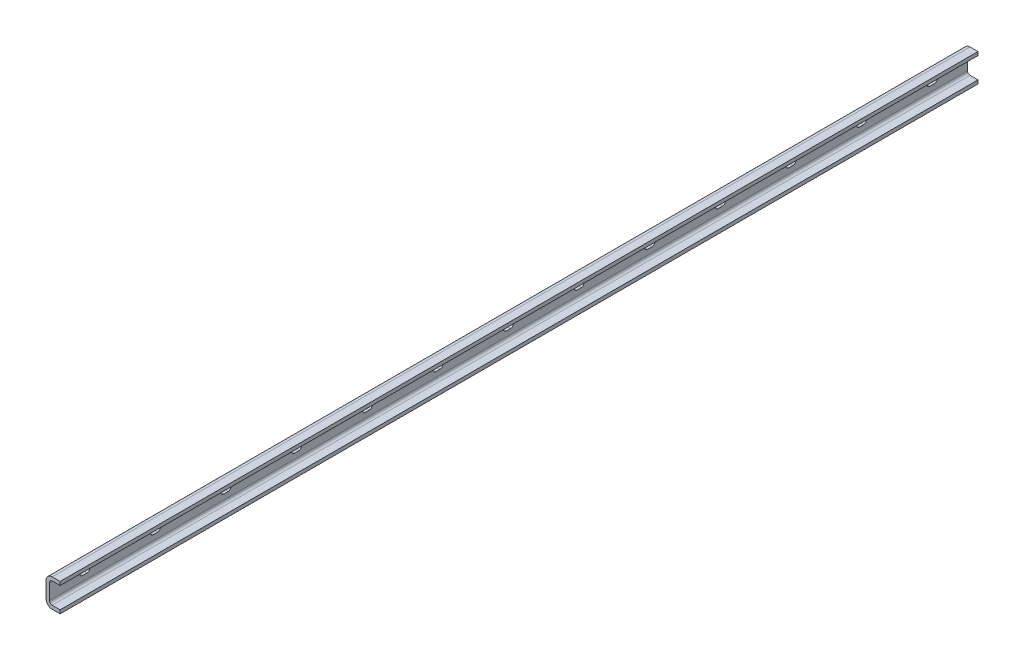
ISO-10303-21;
HEADER;
FILE_DESCRIPTION(('STEP AP214'),'2;1');
FILE_NAME('part.step','',(''),(''),'','','');
FILE_SCHEMA(('AUTOMOTIVE_DESIGN { 1 0 10303 214 1 1 1 1 }'));
ENDSEC;
DATA;
#1=APPLICATION_CONTEXT('core data for automotive mechanical design processes');
#2=APPLICATION_PROTOCOL_DEFINITION('international standard','automotive_design',2000,#1);
#3=PRODUCT_CONTEXT('',#1,'mechanical');
#4=PRODUCT('Part','Part','',(#3));
#5=PRODUCT_RELATED_PRODUCT_CATEGORY('part','',(#4));
#6=PRODUCT_DEFINITION_FORMATION('','',#4);
#7=PRODUCT_DEFINITION_CONTEXT('part definition',#1,'design');
#8=PRODUCT_DEFINITION('design','',#6,#7);
#9=PRODUCT_DEFINITION_SHAPE('','',#8);
#10=(LENGTH_UNIT() NAMED_UNIT(*) SI_UNIT(.MILLI.,.METRE.));
#11=(NAMED_UNIT(*) PLANE_ANGLE_UNIT() SI_UNIT($,.RADIAN.));
#12=(NAMED_UNIT(*) SI_UNIT($,.STERADIAN.) SOLID_ANGLE_UNIT());
#13=UNCERTAINTY_MEASURE_WITH_UNIT(LENGTH_MEASURE(1.E-05),#10,'distance_accuracy_value','');
#14=(GEOMETRIC_REPRESENTATION_CONTEXT(3) GLOBAL_UNCERTAINTY_ASSIGNED_CONTEXT((#13)) GLOBAL_UNIT_ASSIGNED_CONTEXT((#10,
#11,#12)) REPRESENTATION_CONTEXT('',''));
#15=CARTESIAN_POINT('',(0.,0.,0.));
#16=DIRECTION('',(0.,0.,1.));
#17=DIRECTION('',(1.,0.,0.));
#18=AXIS2_PLACEMENT_3D('',#15,#16,#17);
#19=CARTESIAN_POINT('',(7.,11.9,-1040.));
#20=DIRECTION('',(0.,-1.,0.));
#21=DIRECTION('',(0.,0.,-1.));
#22=AXIS2_PLACEMENT_3D('',#19,#20,#21);
#23=PLANE('',#22);
#24=DIRECTION('',(1.,0.,0.));
#25=VECTOR('',#24,1.);
#26=CARTESIAN_POINT('',(7.,11.9,0.));
#27=LINE('',#26,#25);
#28=CARTESIAN_POINT('',(7.,11.9,0.));
#29=VERTEX_POINT('',#28);
#30=CARTESIAN_POINT('',(16.,11.9,0.));
#31=VERTEX_POINT('',#30);
#32=EDGE_CURVE('E532',#29,#31,#27,.T.);
#33=ORIENTED_EDGE('',*,*,#32,.F.);
#34=DIRECTION('',(0.,0.,1.));
#35=VECTOR('',#34,1.);
#36=CARTESIAN_POINT('',(7.,11.9,-1040.));
#37=LINE('',#36,#35);
#38=CARTESIAN_POINT('',(7.,11.9,-1040.));
#39=VERTEX_POINT('',#38);
#40=EDGE_CURVE('E638',#39,#29,#37,.T.);
#41=ORIENTED_EDGE('',*,*,#40,.F.);
#42=DIRECTION('',(1.,0.,0.));
#43=VECTOR('',#42,1.);
#44=CARTESIAN_POINT('',(7.,11.9,-1040.));
#45=LINE('',#44,#43);
#46=CARTESIAN_POINT('',(16.,11.9,-1040.));
#47=VERTEX_POINT('',#46);
#48=EDGE_CURVE('E542',#39,#47,#45,.T.);
#49=ORIENTED_EDGE('',*,*,#48,.T.);
#50=DIRECTION('',(0.,0.,1.));
#51=VECTOR('',#50,1.);
#52=CARTESIAN_POINT('',(16.,11.9,-1040.));
#53=LINE('',#52,#51);
#54=EDGE_CURVE('E591',#47,#31,#53,.T.);
#55=ORIENTED_EDGE('',*,*,#54,.T.);
#56=EDGE_LOOP('',(#33,#41,#49,#55));
#57=FACE_BOUND('',#56,.T.);
#58=ADVANCED_FACE('F39',(#57),#23,.T.);
#59=CARTESIAN_POINT('',(7.00000000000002,8.89999999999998,-1040.));
#60=DIRECTION('',(0.,0.,1.));
#61=DIRECTION('',(1.,0.,0.));
#62=AXIS2_PLACEMENT_3D('',#59,#60,#61);
#63=CYLINDRICAL_SURFACE('',#62,3.00000000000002);
#64=CARTESIAN_POINT('',(7.00000000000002,8.89999999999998,0.));
#65=DIRECTION('',(0.,0.,-1.));
#66=DIRECTION('',(-1.,0.,0.));
#67=AXIS2_PLACEMENT_3D('',#64,#65,#66);
#68=CIRCLE('',#67,3.00000000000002);
#69=CARTESIAN_POINT('',(4.,8.89999999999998,0.));
#70=VERTEX_POINT('',#69);
#71=EDGE_CURVE('E547',#70,#29,#68,.T.);
#72=ORIENTED_EDGE('',*,*,#71,.F.);
#73=DIRECTION('',(0.,0.,1.));
#74=VECTOR('',#73,1.);
#75=CARTESIAN_POINT('',(4.,8.89999999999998,-1040.));
#76=LINE('',#75,#74);
#77=CARTESIAN_POINT('',(4.,8.89999999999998,-1040.));
#78=VERTEX_POINT('',#77);
#79=EDGE_CURVE('E642',#78,#70,#76,.T.);
#80=ORIENTED_EDGE('',*,*,#79,.F.);
#81=CARTESIAN_POINT('',(7.00000000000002,8.89999999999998,-1040.));
#82=DIRECTION('',(0.,0.,-1.));
#83=DIRECTION('',(-1.,0.,0.));
#84=AXIS2_PLACEMENT_3D('',#81,#82,#83);
#85=CIRCLE('',#84,3.00000000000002);
#86=EDGE_CURVE('E587',#78,#39,#85,.T.);
#87=ORIENTED_EDGE('',*,*,#86,.T.);
#88=ORIENTED_EDGE('',*,*,#40,.T.);
#89=EDGE_LOOP('',(#72,#80,#87,#88));
#90=FACE_BOUND('',#89,.T.);
#91=ADVANCED_FACE('F1164',(#90),#63,.F.);
#92=CARTESIAN_POINT('',(4.,-8.9,-1040.));
#93=DIRECTION('',(1.,0.,0.));
#94=DIRECTION('',(0.,0.,-1.));
#95=AXIS2_PLACEMENT_3D('',#92,#93,#94);
#96=PLANE('',#95);
#97=CARTESIAN_POINT('',(4.,0.,-117.5));
#98=DIRECTION('',(1.,0.,0.));
#99=DIRECTION('',(0.,0.,-1.));
#100=AXIS2_PLACEMENT_3D('',#97,#98,#99);
#101=CIRCLE('',#100,3.);
#102=CARTESIAN_POINT('',(4.,3.,-117.5));
#103=VERTEX_POINT('',#102);
#104=CARTESIAN_POINT('',(4.,-3.,-117.5));
#105=VERTEX_POINT('',#104);
#106=EDGE_CURVE('E490',#103,#105,#101,.T.);
#107=ORIENTED_EDGE('',*,*,#106,.F.);
#108=DIRECTION('',(0.,0.,1.));
#109=VECTOR('',#108,1.);
#110=CARTESIAN_POINT('',(4.,3.,-117.5));
#111=LINE('',#110,#109);
#112=CARTESIAN_POINT('',(4.,3.,-122.5));
#113=VERTEX_POINT('',#112);
#114=EDGE_CURVE('E467',#113,#103,#111,.T.);
#115=ORIENTED_EDGE('',*,*,#114,.F.);
#116=CARTESIAN_POINT('',(4.,0.,-122.5));
#117=DIRECTION('',(1.,0.,0.));
#118=DIRECTION('',(0.,0.,1.));
#119=AXIS2_PLACEMENT_3D('',#116,#117,#118);
#120=CIRCLE('',#119,3.);
#121=CARTESIAN_POINT('',(4.,-3.,-122.5));
#122=VERTEX_POINT('',#121);
#123=EDGE_CURVE('E458',#122,#113,#120,.T.);
#124=ORIENTED_EDGE('',*,*,#123,.F.);
#125=DIRECTION('',(0.,0.,-1.));
#126=VECTOR('',#125,1.);
#127=CARTESIAN_POINT('',(4.,-3.,-117.5));
#128=LINE('',#127,#126);
#129=EDGE_CURVE('E443',#105,#122,#128,.T.);
#130=ORIENTED_EDGE('',*,*,#129,.F.);
#131=EDGE_LOOP('',(#107,#115,#124,#130));
#132=FACE_BOUND('',#131,.T.);
#133=CARTESIAN_POINT('',(4.,0.,-37.5));
#134=DIRECTION('',(1.,0.,0.));
#135=DIRECTION('',(0.,0.,-1.));
#136=AXIS2_PLACEMENT_3D('',#133,#134,#135);
#137=CIRCLE('',#136,3.);
#138=CARTESIAN_POINT('',(4.,3.,-37.5));
#139=VERTEX_POINT('',#138);
#140=CARTESIAN_POINT('',(4.,-3.,-37.4999999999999));
#141=VERTEX_POINT('',#140);
#142=EDGE_CURVE('E497',#139,#141,#137,.T.);
#143=ORIENTED_EDGE('',*,*,#142,.F.);
#144=DIRECTION('',(0.,0.,1.));
#145=VECTOR('',#144,1.);
#146=CARTESIAN_POINT('',(4.,3.,-37.5));
#147=LINE('',#146,#145);
#148=CARTESIAN_POINT('',(4.,3.,-42.5));
#149=VERTEX_POINT('',#148);
#150=EDGE_CURVE('E503',#149,#139,#147,.T.);
#151=ORIENTED_EDGE('',*,*,#150,.F.);
#152=CARTESIAN_POINT('',(4.,0.,-42.5));
#153=DIRECTION('',(1.,0.,0.));
#154=DIRECTION('',(0.,0.,1.));
#155=AXIS2_PLACEMENT_3D('',#152,#153,#154);
#156=CIRCLE('',#155,3.);
#157=CARTESIAN_POINT('',(4.,-3.,-42.5));
#158=VERTEX_POINT('',#157);
#159=EDGE_CURVE('E522',#158,#149,#156,.T.);
#160=ORIENTED_EDGE('',*,*,#159,.F.);
#161=DIRECTION('',(0.,0.,-1.));
#162=VECTOR('',#161,1.);
#163=CARTESIAN_POINT('',(4.,-3.,-37.5));
#164=LINE('',#163,#162);
#165=EDGE_CURVE('E518',#141,#158,#164,.T.);
#166=ORIENTED_EDGE('',*,*,#165,.F.);
#167=EDGE_LOOP('',(#143,#151,#160,#166));
#168=FACE_BOUND('',#167,.T.);
#169=DIRECTION('',(0.,1.,0.));
#170=VECTOR('',#169,1.);
#171=CARTESIAN_POINT('',(4.,-8.9,0.));
#172=LINE('',#171,#170);
#173=CARTESIAN_POINT('',(4.,-8.9,0.));
#174=VERTEX_POINT('',#173);
#175=EDGE_CURVE('E631',#174,#70,#172,.T.);
#176=ORIENTED_EDGE('',*,*,#175,.F.);
#177=DIRECTION('',(0.,0.,1.));
#178=VECTOR('',#177,1.);
#179=CARTESIAN_POINT('',(4.,-8.9,-1040.));
#180=LINE('',#179,#178);
#181=CARTESIAN_POINT('',(4.,-8.9,-1040.));
#182=VERTEX_POINT('',#181);
#183=EDGE_CURVE('E645',#182,#174,#180,.T.);
#184=ORIENTED_EDGE('',*,*,#183,.F.);
#185=DIRECTION('',(0.,1.,0.));
#186=VECTOR('',#185,1.);
#187=CARTESIAN_POINT('',(4.,-8.9,-1040.));
#188=LINE('',#187,#186);
#189=EDGE_CURVE('E583',#182,#78,#188,.T.);
#190=ORIENTED_EDGE('',*,*,#189,.T.);
#191=ORIENTED_EDGE('',*,*,#79,.T.);
#192=EDGE_LOOP('',(#176,#184,#190,#191));
#193=FACE_BOUND('',#192,.T.);
#194=CARTESIAN_POINT('',(4.,0.,-197.5));
#195=DIRECTION('',(1.,0.,0.));
#196=DIRECTION('',(0.,0.,-1.));
#197=AXIS2_PLACEMENT_3D('',#194,#195,#196);
#198=CIRCLE('',#197,3.);
#199=CARTESIAN_POINT('',(4.,3.,-197.5));
#200=VERTEX_POINT('',#199);
#201=CARTESIAN_POINT('',(4.,-3.,-197.5));
#202=VERTEX_POINT('',#201);
#203=EDGE_CURVE('E641',#200,#202,#198,.T.);
#204=ORIENTED_EDGE('',*,*,#203,.F.);
#205=DIRECTION('',(0.,0.,1.));
#206=VECTOR('',#205,1.);
#207=CARTESIAN_POINT('',(4.,3.,-197.5));
#208=LINE('',#207,#206);
#209=CARTESIAN_POINT('',(4.,3.,-202.5));
#210=VERTEX_POINT('',#209);
#211=EDGE_CURVE('E676',#210,#200,#208,.T.);
#212=ORIENTED_EDGE('',*,*,#211,.F.);
#213=CARTESIAN_POINT('',(4.,0.,-202.5));
#214=DIRECTION('',(1.,0.,0.));
#215=DIRECTION('',(0.,0.,1.));
#216=AXIS2_PLACEMENT_3D('',#213,#214,#215);
#217=CIRCLE('',#216,3.);
#218=CARTESIAN_POINT('',(4.,-3.,-202.5));
#219=VERTEX_POINT('',#218);
#220=EDGE_CURVE('E680',#219,#210,#217,.T.);
#221=ORIENTED_EDGE('',*,*,#220,.F.);
#222=DIRECTION('',(0.,0.,-1.));
#223=VECTOR('',#222,1.);
#224=CARTESIAN_POINT('',(4.,-3.,-197.5));
#225=LINE('',#224,#223);
#226=EDGE_CURVE('E684',#202,#219,#225,.T.);
#227=ORIENTED_EDGE('',*,*,#226,.F.);
#228=EDGE_LOOP('',(#204,#212,#221,#227));
#229=FACE_BOUND('',#228,.T.);
#230=CARTESIAN_POINT('',(4.,0.,-277.5));
#231=DIRECTION('',(1.,0.,0.));
#232=DIRECTION('',(0.,0.,-1.));
#233=AXIS2_PLACEMENT_3D('',#230,#231,#232);
#234=CIRCLE('',#233,3.);
#235=CARTESIAN_POINT('',(4.,3.,-277.5));
#236=VERTEX_POINT('',#235);
#237=CARTESIAN_POINT('',(4.,-3.,-277.5));
#238=VERTEX_POINT('',#237);
#239=EDGE_CURVE('E717',#236,#238,#234,.T.);
#240=ORIENTED_EDGE('',*,*,#239,.F.);
#241=DIRECTION('',(0.,0.,1.));
#242=VECTOR('',#241,1.);
#243=CARTESIAN_POINT('',(4.,3.,-277.5));
#244=LINE('',#243,#242);
#245=CARTESIAN_POINT('',(4.,3.,-282.5));
#246=VERTEX_POINT('',#245);
#247=EDGE_CURVE('E720',#246,#236,#244,.T.);
#248=ORIENTED_EDGE('',*,*,#247,.F.);
#249=CARTESIAN_POINT('',(4.,0.,-282.5));
#250=DIRECTION('',(1.,0.,0.));
#251=DIRECTION('',(0.,0.,1.));
#252=AXIS2_PLACEMENT_3D('',#249,#250,#251);
#253=CIRCLE('',#252,3.);
#254=CARTESIAN_POINT('',(4.,-3.,-282.5));
#255=VERTEX_POINT('',#254);
#256=EDGE_CURVE('E724',#255,#246,#253,.T.);
#257=ORIENTED_EDGE('',*,*,#256,.F.);
#258=DIRECTION('',(0.,0.,-1.));
#259=VECTOR('',#258,1.);
#260=CARTESIAN_POINT('',(4.,-3.,-277.5));
#261=LINE('',#260,#259);
#262=EDGE_CURVE('E728',#238,#255,#261,.T.);
#263=ORIENTED_EDGE('',*,*,#262,.F.);
#264=EDGE_LOOP('',(#240,#248,#257,#263));
#265=FACE_BOUND('',#264,.T.);
#266=CARTESIAN_POINT('',(4.,0.,-357.5));
#267=DIRECTION('',(1.,0.,0.));
#268=DIRECTION('',(0.,0.,-1.));
#269=AXIS2_PLACEMENT_3D('',#266,#267,#268);
#270=CIRCLE('',#269,3.);
#271=CARTESIAN_POINT('',(4.,3.,-357.5));
#272=VERTEX_POINT('',#271);
#273=CARTESIAN_POINT('',(4.,-3.,-357.5));
#274=VERTEX_POINT('',#273);
#275=EDGE_CURVE('E761',#272,#274,#270,.T.);
#276=ORIENTED_EDGE('',*,*,#275,.F.);
#277=DIRECTION('',(0.,0.,1.));
#278=VECTOR('',#277,1.);
#279=CARTESIAN_POINT('',(4.,3.,-357.5));
#280=LINE('',#279,#278);
#281=CARTESIAN_POINT('',(4.,3.,-362.5));
#282=VERTEX_POINT('',#281);
#283=EDGE_CURVE('E764',#282,#272,#280,.T.);
#284=ORIENTED_EDGE('',*,*,#283,.F.);
#285=CARTESIAN_POINT('',(4.,0.,-362.5));
#286=DIRECTION('',(1.,0.,0.));
#287=DIRECTION('',(0.,0.,1.));
#288=AXIS2_PLACEMENT_3D('',#285,#286,#287);
#289=CIRCLE('',#288,3.);
#290=CARTESIAN_POINT('',(4.,-3.,-362.5));
#291=VERTEX_POINT('',#290);
#292=EDGE_CURVE('E768',#291,#282,#289,.T.);
#293=ORIENTED_EDGE('',*,*,#292,.F.);
#294=DIRECTION('',(0.,0.,-1.));
#295=VECTOR('',#294,1.);
#296=CARTESIAN_POINT('',(4.,-3.,-357.5));
#297=LINE('',#296,#295);
#298=EDGE_CURVE('E772',#274,#291,#297,.T.);
#299=ORIENTED_EDGE('',*,*,#298,.F.);
#300=EDGE_LOOP('',(#276,#284,#293,#299));
#301=FACE_BOUND('',#300,.T.);
#302=CARTESIAN_POINT('',(4.,0.,-437.5));
#303=DIRECTION('',(1.,0.,0.));
#304=DIRECTION('',(0.,0.,-1.));
#305=AXIS2_PLACEMENT_3D('',#302,#303,#304);
#306=CIRCLE('',#305,3.);
#307=CARTESIAN_POINT('',(4.,3.,-437.5));
#308=VERTEX_POINT('',#307);
#309=CARTESIAN_POINT('',(4.,-3.,-437.5));
#310=VERTEX_POINT('',#309);
#311=EDGE_CURVE('E805',#308,#310,#306,.T.);
#312=ORIENTED_EDGE('',*,*,#311,.F.);
#313=DIRECTION('',(0.,0.,1.));
#314=VECTOR('',#313,1.);
#315=CARTESIAN_POINT('',(4.,3.,-437.5));
#316=LINE('',#315,#314);
#317=CARTESIAN_POINT('',(4.,3.,-442.5));
#318=VERTEX_POINT('',#317);
#319=EDGE_CURVE('E807',#318,#308,#316,.T.);
#320=ORIENTED_EDGE('',*,*,#319,.F.);
#321=CARTESIAN_POINT('',(4.,0.,-442.5));
#322=DIRECTION('',(1.,0.,0.));
#323=DIRECTION('',(0.,0.,1.));
#324=AXIS2_PLACEMENT_3D('',#321,#322,#323);
#325=CIRCLE('',#324,3.);
#326=CARTESIAN_POINT('',(4.,-3.,-442.5));
#327=VERTEX_POINT('',#326);
#328=EDGE_CURVE('E811',#327,#318,#325,.T.);
#329=ORIENTED_EDGE('',*,*,#328,.F.);
#330=DIRECTION('',(0.,0.,-1.));
#331=VECTOR('',#330,1.);
#332=CARTESIAN_POINT('',(4.,-3.,-437.5));
#333=LINE('',#332,#331);
#334=EDGE_CURVE('E815',#310,#327,#333,.T.);
#335=ORIENTED_EDGE('',*,*,#334,.F.);
#336=EDGE_LOOP('',(#312,#320,#329,#335));
#337=FACE_BOUND('',#336,.T.);
#338=CARTESIAN_POINT('',(4.,0.,-517.5));
#339=DIRECTION('',(1.,0.,0.));
#340=DIRECTION('',(0.,0.,-1.));
#341=AXIS2_PLACEMENT_3D('',#338,#339,#340);
#342=CIRCLE('',#341,3.);
#343=CARTESIAN_POINT('',(4.,3.,-517.5));
#344=VERTEX_POINT('',#343);
#345=CARTESIAN_POINT('',(4.,-3.,-517.5));
#346=VERTEX_POINT('',#345);
#347=EDGE_CURVE('E848',#344,#346,#342,.T.);
#348=ORIENTED_EDGE('',*,*,#347,.F.);
#349=DIRECTION('',(0.,0.,1.));
#350=VECTOR('',#349,1.);
#351=CARTESIAN_POINT('',(4.,3.,-517.5));
#352=LINE('',#351,#350);
#353=CARTESIAN_POINT('',(4.,3.,-522.5));
#354=VERTEX_POINT('',#353);
#355=EDGE_CURVE('E851',#354,#344,#352,.T.);
#356=ORIENTED_EDGE('',*,*,#355,.F.);
#357=CARTESIAN_POINT('',(4.,0.,-522.5));
#358=DIRECTION('',(1.,0.,0.));
#359=DIRECTION('',(0.,0.,1.));
#360=AXIS2_PLACEMENT_3D('',#357,#358,#359);
#361=CIRCLE('',#360,3.);
#362=CARTESIAN_POINT('',(4.,-3.,-522.5));
#363=VERTEX_POINT('',#362);
#364=EDGE_CURVE('E855',#363,#354,#361,.T.);
#365=ORIENTED_EDGE('',*,*,#364,.F.);
#366=DIRECTION('',(0.,0.,-1.));
#367=VECTOR('',#366,1.);
#368=CARTESIAN_POINT('',(4.,-3.,-517.5));
#369=LINE('',#368,#367);
#370=EDGE_CURVE('E859',#346,#363,#369,.T.);
#371=ORIENTED_EDGE('',*,*,#370,.F.);
#372=EDGE_LOOP('',(#348,#356,#365,#371));
#373=FACE_BOUND('',#372,.T.);
#374=CARTESIAN_POINT('',(4.,0.,-597.5));
#375=DIRECTION('',(1.,0.,0.));
#376=DIRECTION('',(0.,0.,-1.));
#377=AXIS2_PLACEMENT_3D('',#374,#375,#376);
#378=CIRCLE('',#377,3.);
#379=CARTESIAN_POINT('',(4.,3.,-597.5));
#380=VERTEX_POINT('',#379);
#381=CARTESIAN_POINT('',(4.,-3.,-597.5));
#382=VERTEX_POINT('',#381);
#383=EDGE_CURVE('E892',#380,#382,#378,.T.);
#384=ORIENTED_EDGE('',*,*,#383,.F.);
#385=DIRECTION('',(0.,0.,1.));
#386=VECTOR('',#385,1.);
#387=CARTESIAN_POINT('',(4.,3.,-597.5));
#388=LINE('',#387,#386);
#389=CARTESIAN_POINT('',(4.,3.,-602.5));
#390=VERTEX_POINT('',#389);
#391=EDGE_CURVE('E895',#390,#380,#388,.T.);
#392=ORIENTED_EDGE('',*,*,#391,.F.);
#393=CARTESIAN_POINT('',(4.,0.,-602.5));
#394=DIRECTION('',(1.,0.,0.));
#395=DIRECTION('',(0.,0.,1.));
#396=AXIS2_PLACEMENT_3D('',#393,#394,#395);
#397=CIRCLE('',#396,3.);
#398=CARTESIAN_POINT('',(4.,-3.,-602.5));
#399=VERTEX_POINT('',#398);
#400=EDGE_CURVE('E899',#399,#390,#397,.T.);
#401=ORIENTED_EDGE('',*,*,#400,.F.);
#402=DIRECTION('',(0.,0.,-1.));
#403=VECTOR('',#402,1.);
#404=CARTESIAN_POINT('',(4.,-3.,-597.5));
#405=LINE('',#404,#403);
#406=EDGE_CURVE('E903',#382,#399,#405,.T.);
#407=ORIENTED_EDGE('',*,*,#406,.F.);
#408=EDGE_LOOP('',(#384,#392,#401,#407));
#409=FACE_BOUND('',#408,.T.);
#410=CARTESIAN_POINT('',(4.,0.,-677.5));
#411=DIRECTION('',(1.,0.,0.));
#412=DIRECTION('',(0.,0.,-1.));
#413=AXIS2_PLACEMENT_3D('',#410,#411,#412);
#414=CIRCLE('',#413,3.);
#415=CARTESIAN_POINT('',(4.,3.,-677.5));
#416=VERTEX_POINT('',#415);
#417=CARTESIAN_POINT('',(4.,-3.,-677.5));
#418=VERTEX_POINT('',#417);
#419=EDGE_CURVE('E936',#416,#418,#414,.T.);
#420=ORIENTED_EDGE('',*,*,#419,.F.);
#421=DIRECTION('',(0.,0.,1.));
#422=VECTOR('',#421,1.);
#423=CARTESIAN_POINT('',(4.,3.,-677.5));
#424=LINE('',#423,#422);
#425=CARTESIAN_POINT('',(4.,3.,-682.5));
#426=VERTEX_POINT('',#425);
#427=EDGE_CURVE('E939',#426,#416,#424,.T.);
#428=ORIENTED_EDGE('',*,*,#427,.F.);
#429=CARTESIAN_POINT('',(4.,0.,-682.5));
#430=DIRECTION('',(1.,0.,0.));
#431=DIRECTION('',(0.,0.,1.));
#432=AXIS2_PLACEMENT_3D('',#429,#430,#431);
#433=CIRCLE('',#432,3.);
#434=CARTESIAN_POINT('',(4.,-3.,-682.5));
#435=VERTEX_POINT('',#434);
#436=EDGE_CURVE('E943',#435,#426,#433,.T.);
#437=ORIENTED_EDGE('',*,*,#436,.F.);
#438=DIRECTION('',(0.,0.,-1.));
#439=VECTOR('',#438,1.);
#440=CARTESIAN_POINT('',(4.,-3.,-677.5));
#441=LINE('',#440,#439);
#442=EDGE_CURVE('E947',#418,#435,#441,.T.);
#443=ORIENTED_EDGE('',*,*,#442,.F.);
#444=EDGE_LOOP('',(#420,#428,#437,#443));
#445=FACE_BOUND('',#444,.T.);
#446=CARTESIAN_POINT('',(4.,0.,-757.5));
#447=DIRECTION('',(1.,0.,0.));
#448=DIRECTION('',(0.,0.,-1.));
#449=AXIS2_PLACEMENT_3D('',#446,#447,#448);
#450=CIRCLE('',#449,3.);
#451=CARTESIAN_POINT('',(4.,3.,-757.5));
#452=VERTEX_POINT('',#451);
#453=CARTESIAN_POINT('',(4.,-3.,-757.5));
#454=VERTEX_POINT('',#453);
#455=EDGE_CURVE('E980',#452,#454,#450,.T.);
#456=ORIENTED_EDGE('',*,*,#455,.F.);
#457=DIRECTION('',(0.,0.,1.));
#458=VECTOR('',#457,1.);
#459=CARTESIAN_POINT('',(4.,3.,-757.5));
#460=LINE('',#459,#458);
#461=CARTESIAN_POINT('',(4.,3.,-762.5));
#462=VERTEX_POINT('',#461);
#463=EDGE_CURVE('E983',#462,#452,#460,.T.);
#464=ORIENTED_EDGE('',*,*,#463,.F.);
#465=CARTESIAN_POINT('',(4.,0.,-762.5));
#466=DIRECTION('',(1.,0.,0.));
#467=DIRECTION('',(0.,0.,1.));
#468=AXIS2_PLACEMENT_3D('',#465,#466,#467);
#469=CIRCLE('',#468,3.);
#470=CARTESIAN_POINT('',(4.,-3.,-762.5));
#471=VERTEX_POINT('',#470);
#472=EDGE_CURVE('E987',#471,#462,#469,.T.);
#473=ORIENTED_EDGE('',*,*,#472,.F.);
#474=DIRECTION('',(0.,0.,-1.));
#475=VECTOR('',#474,1.);
#476=CARTESIAN_POINT('',(4.,-3.,-757.5));
#477=LINE('',#476,#475);
#478=EDGE_CURVE('E991',#454,#471,#477,.T.);
#479=ORIENTED_EDGE('',*,*,#478,.F.);
#480=EDGE_LOOP('',(#456,#464,#473,#479));
#481=FACE_BOUND('',#480,.T.);
#482=CARTESIAN_POINT('',(4.,0.,-837.5));
#483=DIRECTION('',(1.,0.,0.));
#484=DIRECTION('',(0.,0.,-1.));
#485=AXIS2_PLACEMENT_3D('',#482,#483,#484);
#486=CIRCLE('',#485,3.);
#487=CARTESIAN_POINT('',(4.,3.,-837.5));
#488=VERTEX_POINT('',#487);
#489=CARTESIAN_POINT('',(4.,-3.,-837.5));
#490=VERTEX_POINT('',#489);
#491=EDGE_CURVE('E1024',#488,#490,#486,.T.);
#492=ORIENTED_EDGE('',*,*,#491,.F.);
#493=DIRECTION('',(0.,0.,1.));
#494=VECTOR('',#493,1.);
#495=CARTESIAN_POINT('',(4.,3.,-837.5));
#496=LINE('',#495,#494);
#497=CARTESIAN_POINT('',(4.,3.,-842.5));
#498=VERTEX_POINT('',#497);
#499=EDGE_CURVE('E1027',#498,#488,#496,.T.);
#500=ORIENTED_EDGE('',*,*,#499,.F.);
#501=CARTESIAN_POINT('',(4.,0.,-842.5));
#502=DIRECTION('',(1.,0.,0.));
#503=DIRECTION('',(0.,0.,1.));
#504=AXIS2_PLACEMENT_3D('',#501,#502,#503);
#505=CIRCLE('',#504,3.);
#506=CARTESIAN_POINT('',(4.,-3.,-842.5));
#507=VERTEX_POINT('',#506);
#508=EDGE_CURVE('E1031',#507,#498,#505,.T.);
#509=ORIENTED_EDGE('',*,*,#508,.F.);
#510=DIRECTION('',(0.,0.,-1.));
#511=VECTOR('',#510,1.);
#512=CARTESIAN_POINT('',(4.,-3.,-837.5));
#513=LINE('',#512,#511);
#514=EDGE_CURVE('E1035',#490,#507,#513,.T.);
#515=ORIENTED_EDGE('',*,*,#514,.F.);
#516=EDGE_LOOP('',(#492,#500,#509,#515));
#517=FACE_BOUND('',#516,.T.);
#518=CARTESIAN_POINT('',(4.,0.,-917.5));
#519=DIRECTION('',(1.,0.,0.));
#520=DIRECTION('',(0.,0.,-1.));
#521=AXIS2_PLACEMENT_3D('',#518,#519,#520);
#522=CIRCLE('',#521,3.);
#523=CARTESIAN_POINT('',(4.,3.,-917.5));
#524=VERTEX_POINT('',#523);
#525=CARTESIAN_POINT('',(4.,-3.,-917.5));
#526=VERTEX_POINT('',#525);
#527=EDGE_CURVE('E1068',#524,#526,#522,.T.);
#528=ORIENTED_EDGE('',*,*,#527,.F.);
#529=DIRECTION('',(0.,0.,1.));
#530=VECTOR('',#529,1.);
#531=CARTESIAN_POINT('',(4.,3.,-917.5));
#532=LINE('',#531,#530);
#533=CARTESIAN_POINT('',(4.,3.,-922.5));
#534=VERTEX_POINT('',#533);
#535=EDGE_CURVE('E1071',#534,#524,#532,.T.);
#536=ORIENTED_EDGE('',*,*,#535,.F.);
#537=CARTESIAN_POINT('',(4.,0.,-922.5));
#538=DIRECTION('',(1.,0.,0.));
#539=DIRECTION('',(0.,0.,1.));
#540=AXIS2_PLACEMENT_3D('',#537,#538,#539);
#541=CIRCLE('',#540,3.);
#542=CARTESIAN_POINT('',(4.,-3.,-922.5));
#543=VERTEX_POINT('',#542);
#544=EDGE_CURVE('E1075',#543,#534,#541,.T.);
#545=ORIENTED_EDGE('',*,*,#544,.F.);
#546=DIRECTION('',(0.,0.,-1.));
#547=VECTOR('',#546,1.);
#548=CARTESIAN_POINT('',(4.,-3.,-917.5));
#549=LINE('',#548,#547);
#550=EDGE_CURVE('E1079',#526,#543,#549,.T.);
#551=ORIENTED_EDGE('',*,*,#550,.F.);
#552=EDGE_LOOP('',(#528,#536,#545,#551));
#553=FACE_BOUND('',#552,.T.);
#554=CARTESIAN_POINT('',(4.,0.,-997.5));
#555=DIRECTION('',(1.,0.,0.));
#556=DIRECTION('',(0.,0.,-1.));
#557=AXIS2_PLACEMENT_3D('',#554,#555,#556);
#558=CIRCLE('',#557,3.);
#559=CARTESIAN_POINT('',(4.,3.,-997.5));
#560=VERTEX_POINT('',#559);
#561=CARTESIAN_POINT('',(4.,-3.,-997.5));
#562=VERTEX_POINT('',#561);
#563=EDGE_CURVE('E1111',#560,#562,#558,.T.);
#564=ORIENTED_EDGE('',*,*,#563,.F.);
#565=DIRECTION('',(0.,0.,1.));
#566=VECTOR('',#565,1.);
#567=CARTESIAN_POINT('',(4.,3.,-997.5));
#568=LINE('',#567,#566);
#569=CARTESIAN_POINT('',(4.,3.,-1002.5));
#570=VERTEX_POINT('',#569);
#571=EDGE_CURVE('E1114',#570,#560,#568,.T.);
#572=ORIENTED_EDGE('',*,*,#571,.F.);
#573=CARTESIAN_POINT('',(4.,0.,-1002.5));
#574=DIRECTION('',(1.,0.,0.));
#575=DIRECTION('',(0.,0.,1.));
#576=AXIS2_PLACEMENT_3D('',#573,#574,#575);
#577=CIRCLE('',#576,3.);
#578=CARTESIAN_POINT('',(4.,-3.,-1002.5));
#579=VERTEX_POINT('',#578);
#580=EDGE_CURVE('E1118',#579,#570,#577,.T.);
#581=ORIENTED_EDGE('',*,*,#580,.F.);
#582=DIRECTION('',(0.,0.,-1.));
#583=VECTOR('',#582,1.);
#584=CARTESIAN_POINT('',(4.,-3.,-997.5));
#585=LINE('',#584,#583);
#586=EDGE_CURVE('E1122',#562,#579,#585,.T.);
#587=ORIENTED_EDGE('',*,*,#586,.F.);
#588=EDGE_LOOP('',(#564,#572,#581,#587));
#589=FACE_BOUND('',#588,.T.);
#590=ADVANCED_FACE('F465',(#132,#168,#193,#229,#265,#301,#337,#373,#409,#445,#481,#517,#553,
#589),#96,.T.);
#591=CARTESIAN_POINT('',(7.,-8.9,-1040.));
#592=DIRECTION('',(0.,0.,1.));
#593=DIRECTION('',(1.,0.,0.));
#594=AXIS2_PLACEMENT_3D('',#591,#592,#593);
#595=CYLINDRICAL_SURFACE('',#594,3.);
#596=CARTESIAN_POINT('',(7.,-8.9,0.));
#597=DIRECTION('',(0.,0.,-1.));
#598=DIRECTION('',(-1.,0.,0.));
#599=AXIS2_PLACEMENT_3D('',#596,#597,#598);
#600=CIRCLE('',#599,3.);
#601=CARTESIAN_POINT('',(7.,-11.9,0.));
#602=VERTEX_POINT('',#601);
#603=EDGE_CURVE('E627',#602,#174,#600,.T.);
#604=ORIENTED_EDGE('',*,*,#603,.F.);
#605=DIRECTION('',(0.,0.,1.));
#606=VECTOR('',#605,1.);
#607=CARTESIAN_POINT('',(7.,-11.9,-1040.));
#608=LINE('',#607,#606);
#609=CARTESIAN_POINT('',(7.,-11.9,-1040.));
#610=VERTEX_POINT('',#609);
#611=EDGE_CURVE('E648',#610,#602,#608,.T.);
#612=ORIENTED_EDGE('',*,*,#611,.F.);
#613=CARTESIAN_POINT('',(7.,-8.9,-1040.));
#614=DIRECTION('',(0.,0.,-1.));
#615=DIRECTION('',(-1.,0.,0.));
#616=AXIS2_PLACEMENT_3D('',#613,#614,#615);
#617=CIRCLE('',#616,3.);
#618=EDGE_CURVE('E579',#610,#182,#617,.T.);
#619=ORIENTED_EDGE('',*,*,#618,.T.);
#620=ORIENTED_EDGE('',*,*,#183,.T.);
#621=EDGE_LOOP('',(#604,#612,#619,#620));
#622=FACE_BOUND('',#621,.T.);
#623=ADVANCED_FACE('F1349',(#622),#595,.F.);
#624=CARTESIAN_POINT('',(16.,-11.9,-1040.));
#625=DIRECTION('',(0.,1.,0.));
#626=DIRECTION('',(0.,0.,1.));
#627=AXIS2_PLACEMENT_3D('',#624,#625,#626);
#628=PLANE('',#627);
#629=DIRECTION('',(-1.,0.,0.));
#630=VECTOR('',#629,1.);
#631=CARTESIAN_POINT('',(16.,-11.9,0.));
#632=LINE('',#631,#630);
#633=CARTESIAN_POINT('',(16.,-11.9,0.));
#634=VERTEX_POINT('',#633);
#635=EDGE_CURVE('E623',#634,#602,#632,.T.);
#636=ORIENTED_EDGE('',*,*,#635,.F.);
#637=DIRECTION('',(0.,0.,1.));
#638=VECTOR('',#637,1.);
#639=CARTESIAN_POINT('',(16.,-11.9,-1040.));
#640=LINE('',#639,#638);
#641=CARTESIAN_POINT('',(16.,-11.9,-1040.));
#642=VERTEX_POINT('',#641);
#643=EDGE_CURVE('E651',#642,#634,#640,.T.);
#644=ORIENTED_EDGE('',*,*,#643,.F.);
#645=DIRECTION('',(-1.,0.,0.));
#646=VECTOR('',#645,1.);
#647=CARTESIAN_POINT('',(16.,-11.9,-1040.));
#648=LINE('',#647,#646);
#649=EDGE_CURVE('E575',#642,#610,#648,.T.);
#650=ORIENTED_EDGE('',*,*,#649,.T.);
#651=ORIENTED_EDGE('',*,*,#611,.T.);
#652=EDGE_LOOP('',(#636,#644,#650,#651));
#653=FACE_BOUND('',#652,.T.);
#654=ADVANCED_FACE('F1354',(#653),#628,.T.);
#655=CARTESIAN_POINT('',(16.,-15.9,-1040.));
#656=DIRECTION('',(1.,0.,0.));
#657=DIRECTION('',(0.,0.,-1.));
#658=AXIS2_PLACEMENT_3D('',#655,#656,#657);
#659=PLANE('',#658);
#660=DIRECTION('',(0.,1.,0.));
#661=VECTOR('',#660,1.);
#662=CARTESIAN_POINT('',(16.,-15.9,0.));
#663=LINE('',#662,#661);
#664=CARTESIAN_POINT('',(16.,-15.9,0.));
#665=VERTEX_POINT('',#664);
#666=EDGE_CURVE('E619',#665,#634,#663,.T.);
#667=ORIENTED_EDGE('',*,*,#666,.F.);
#668=DIRECTION('',(0.,0.,1.));
#669=VECTOR('',#668,1.);
#670=CARTESIAN_POINT('',(16.,-15.9,-1040.));
#671=LINE('',#670,#669);
#672=CARTESIAN_POINT('',(16.,-15.9,-1040.));
#673=VERTEX_POINT('',#672);
#674=EDGE_CURVE('E654',#673,#665,#671,.T.);
#675=ORIENTED_EDGE('',*,*,#674,.F.);
#676=DIRECTION('',(0.,1.,0.));
#677=VECTOR('',#676,1.);
#678=CARTESIAN_POINT('',(16.,-15.9,-1040.));
#679=LINE('',#678,#677);
#680=EDGE_CURVE('E571',#673,#642,#679,.T.);
#681=ORIENTED_EDGE('',*,*,#680,.T.);
#682=ORIENTED_EDGE('',*,*,#643,.T.);
#683=EDGE_LOOP('',(#667,#675,#681,#682));
#684=FACE_BOUND('',#683,.T.);
#685=ADVANCED_FACE('F1361',(#684),#659,.T.);
#686=CARTESIAN_POINT('',(7.,-15.9,-1040.));
#687=DIRECTION('',(0.,-1.,0.));
#688=DIRECTION('',(0.,0.,-1.));
#689=AXIS2_PLACEMENT_3D('',#686,#687,#688);
#690=PLANE('',#689);
#691=DIRECTION('',(1.,0.,0.));
#692=VECTOR('',#691,1.);
#693=CARTESIAN_POINT('',(7.,-15.9,0.));
#694=LINE('',#693,#692);
#695=CARTESIAN_POINT('',(7.,-15.9,0.));
#696=VERTEX_POINT('',#695);
#697=EDGE_CURVE('E615',#696,#665,#694,.T.);
#698=ORIENTED_EDGE('',*,*,#697,.F.);
#699=DIRECTION('',(0.,0.,1.));
#700=VECTOR('',#699,1.);
#701=CARTESIAN_POINT('',(7.,-15.9,-1040.));
#702=LINE('',#701,#700);
#703=CARTESIAN_POINT('',(7.,-15.9,-1040.));
#704=VERTEX_POINT('',#703);
#705=EDGE_CURVE('E657',#704,#696,#702,.T.);
#706=ORIENTED_EDGE('',*,*,#705,.F.);
#707=DIRECTION('',(1.,0.,0.));
#708=VECTOR('',#707,1.);
#709=CARTESIAN_POINT('',(7.,-15.9,-1040.));
#710=LINE('',#709,#708);
#711=EDGE_CURVE('E567',#704,#673,#710,.T.);
#712=ORIENTED_EDGE('',*,*,#711,.T.);
#713=ORIENTED_EDGE('',*,*,#674,.T.);
#714=EDGE_LOOP('',(#698,#706,#712,#713));
#715=FACE_BOUND('',#714,.T.);
#716=ADVANCED_FACE('F1365',(#715),#690,.T.);
#717=CARTESIAN_POINT('',(6.99999999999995,-8.90000000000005,-1040.));
#718=DIRECTION('',(0.,0.,1.));
#719=DIRECTION('',(1.,0.,0.));
#720=AXIS2_PLACEMENT_3D('',#717,#718,#719);
#721=CYLINDRICAL_SURFACE('',#720,6.99999999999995);
#722=CARTESIAN_POINT('',(6.99999999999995,-8.90000000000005,0.));
#723=DIRECTION('',(0.,0.,1.));
#724=DIRECTION('',(1.,0.,0.));
#725=AXIS2_PLACEMENT_3D('',#722,#723,#724);
#726=CIRCLE('',#725,6.99999999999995);
#727=CARTESIAN_POINT('',(0.,-8.90000000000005,0.));
#728=VERTEX_POINT('',#727);
#729=EDGE_CURVE('E611',#728,#696,#726,.T.);
#730=ORIENTED_EDGE('',*,*,#729,.F.);
#731=DIRECTION('',(0.,0.,1.));
#732=VECTOR('',#731,1.);
#733=CARTESIAN_POINT('',(0.,-8.90000000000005,-1040.));
#734=LINE('',#733,#732);
#735=CARTESIAN_POINT('',(0.,-8.90000000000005,-1040.));
#736=VERTEX_POINT('',#735);
#737=EDGE_CURVE('E660',#736,#728,#734,.T.);
#738=ORIENTED_EDGE('',*,*,#737,.F.);
#739=CARTESIAN_POINT('',(6.99999999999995,-8.90000000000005,-1040.));
#740=DIRECTION('',(0.,0.,1.));
#741=DIRECTION('',(1.,0.,0.));
#742=AXIS2_PLACEMENT_3D('',#739,#740,#741);
#743=CIRCLE('',#742,6.99999999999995);
#744=EDGE_CURVE('E563',#736,#704,#743,.T.);
#745=ORIENTED_EDGE('',*,*,#744,.T.);
#746=ORIENTED_EDGE('',*,*,#705,.T.);
#747=EDGE_LOOP('',(#730,#738,#745,#746));
#748=FACE_BOUND('',#747,.T.);
#749=ADVANCED_FACE('F1369',(#748),#721,.T.);
#750=CARTESIAN_POINT('',(0.,8.9,-1040.));
#751=DIRECTION('',(-1.,0.,0.));
#752=DIRECTION('',(0.,-1.,0.));
#753=AXIS2_PLACEMENT_3D('',#750,#751,#752);
#754=PLANE('',#753);
#755=CARTESIAN_POINT('',(0.,0.,-117.5));
#756=DIRECTION('',(1.,0.,0.));
#757=DIRECTION('',(0.,0.,-1.));
#758=AXIS2_PLACEMENT_3D('',#755,#756,#757);
#759=CIRCLE('',#758,3.);
#760=CARTESIAN_POINT('',(0.,3.,-117.5));
#761=VERTEX_POINT('',#760);
#762=CARTESIAN_POINT('',(0.,-3.,-117.5));
#763=VERTEX_POINT('',#762);
#764=EDGE_CURVE('E493',#761,#763,#759,.T.);
#765=ORIENTED_EDGE('',*,*,#764,.T.);
#766=DIRECTION('',(0.,0.,-1.));
#767=VECTOR('',#766,1.);
#768=CARTESIAN_POINT('',(0.,-3.,-117.5));
#769=LINE('',#768,#767);
#770=CARTESIAN_POINT('',(0.,-3.,-122.5));
#771=VERTEX_POINT('',#770);
#772=EDGE_CURVE('E454',#763,#771,#769,.T.);
#773=ORIENTED_EDGE('',*,*,#772,.T.);
#774=CARTESIAN_POINT('',(0.,0.,-122.5));
#775=DIRECTION('',(1.,0.,0.));
#776=DIRECTION('',(0.,0.,1.));
#777=AXIS2_PLACEMENT_3D('',#774,#775,#776);
#778=CIRCLE('',#777,3.);
#779=CARTESIAN_POINT('',(0.,3.,-122.5));
#780=VERTEX_POINT('',#779);
#781=EDGE_CURVE('E461',#771,#780,#778,.T.);
#782=ORIENTED_EDGE('',*,*,#781,.T.);
#783=DIRECTION('',(0.,0.,1.));
#784=VECTOR('',#783,1.);
#785=CARTESIAN_POINT('',(0.,3.,-117.5));
#786=LINE('',#785,#784);
#787=EDGE_CURVE('E486',#780,#761,#786,.T.);
#788=ORIENTED_EDGE('',*,*,#787,.T.);
#789=EDGE_LOOP('',(#765,#773,#782,#788));
#790=FACE_BOUND('',#789,.T.);
#791=CARTESIAN_POINT('',(0.,0.,-37.5));
#792=DIRECTION('',(1.,0.,0.));
#793=DIRECTION('',(0.,0.,-1.));
#794=AXIS2_PLACEMENT_3D('',#791,#792,#793);
#795=CIRCLE('',#794,3.);
#796=CARTESIAN_POINT('',(0.,3.,-37.5));
#797=VERTEX_POINT('',#796);
#798=CARTESIAN_POINT('',(0.,-3.,-37.5));
#799=VERTEX_POINT('',#798);
#800=EDGE_CURVE('E498',#797,#799,#795,.T.);
#801=ORIENTED_EDGE('',*,*,#800,.T.);
#802=DIRECTION('',(0.,0.,-1.));
#803=VECTOR('',#802,1.);
#804=CARTESIAN_POINT('',(0.,-3.,-37.5));
#805=LINE('',#804,#803);
#806=CARTESIAN_POINT('',(0.,-3.,-42.5));
#807=VERTEX_POINT('',#806);
#808=EDGE_CURVE('E502',#799,#807,#805,.T.);
#809=ORIENTED_EDGE('',*,*,#808,.T.);
#810=CARTESIAN_POINT('',(0.,0.,-42.5));
#811=DIRECTION('',(1.,0.,0.));
#812=DIRECTION('',(0.,0.,1.));
#813=AXIS2_PLACEMENT_3D('',#810,#811,#812);
#814=CIRCLE('',#813,3.);
#815=CARTESIAN_POINT('',(0.,3.,-42.5));
#816=VERTEX_POINT('',#815);
#817=EDGE_CURVE('E507',#807,#816,#814,.T.);
#818=ORIENTED_EDGE('',*,*,#817,.T.);
#819=DIRECTION('',(0.,0.,1.));
#820=VECTOR('',#819,1.);
#821=CARTESIAN_POINT('',(0.,3.,-37.5));
#822=LINE('',#821,#820);
#823=EDGE_CURVE('E511',#816,#797,#822,.T.);
#824=ORIENTED_EDGE('',*,*,#823,.T.);
#825=EDGE_LOOP('',(#801,#809,#818,#824));
#826=FACE_BOUND('',#825,.T.);
#827=DIRECTION('',(0.,-1.,0.));
#828=VECTOR('',#827,1.);
#829=CARTESIAN_POINT('',(0.,8.9,0.));
#830=LINE('',#829,#828);
#831=CARTESIAN_POINT('',(0.,8.9,0.));
#832=VERTEX_POINT('',#831);
#833=EDGE_CURVE('E607',#832,#728,#830,.T.);
#834=ORIENTED_EDGE('',*,*,#833,.F.);
#835=DIRECTION('',(0.,0.,1.));
#836=VECTOR('',#835,1.);
#837=CARTESIAN_POINT('',(0.,8.9,-1040.));
#838=LINE('',#837,#836);
#839=CARTESIAN_POINT('',(0.,8.9,-1040.));
#840=VERTEX_POINT('',#839);
#841=EDGE_CURVE('E663',#840,#832,#838,.T.);
#842=ORIENTED_EDGE('',*,*,#841,.F.);
#843=DIRECTION('',(0.,-1.,0.));
#844=VECTOR('',#843,1.);
#845=CARTESIAN_POINT('',(0.,8.9,-1040.));
#846=LINE('',#845,#844);
#847=EDGE_CURVE('E559',#840,#736,#846,.T.);
#848=ORIENTED_EDGE('',*,*,#847,.T.);
#849=ORIENTED_EDGE('',*,*,#737,.T.);
#850=EDGE_LOOP('',(#834,#842,#848,#849));
#851=FACE_BOUND('',#850,.T.);
#852=CARTESIAN_POINT('',(0.,0.,-197.5));
#853=DIRECTION('',(1.,0.,0.));
#854=DIRECTION('',(0.,0.,-1.));
#855=AXIS2_PLACEMENT_3D('',#852,#853,#854);
#856=CIRCLE('',#855,3.);
#857=CARTESIAN_POINT('',(0.,3.,-197.5));
#858=VERTEX_POINT('',#857);
#859=CARTESIAN_POINT('',(0.,-3.,-197.5));
#860=VERTEX_POINT('',#859);
#861=EDGE_CURVE('E688',#858,#860,#856,.T.);
#862=ORIENTED_EDGE('',*,*,#861,.T.);
#863=DIRECTION('',(0.,0.,-1.));
#864=VECTOR('',#863,1.);
#865=CARTESIAN_POINT('',(0.,-3.,-197.5));
#866=LINE('',#865,#864);
#867=CARTESIAN_POINT('',(0.,-3.,-202.5));
#868=VERTEX_POINT('',#867);
#869=EDGE_CURVE('E691',#860,#868,#866,.T.);
#870=ORIENTED_EDGE('',*,*,#869,.T.);
#871=CARTESIAN_POINT('',(0.,0.,-202.5));
#872=DIRECTION('',(1.,0.,0.));
#873=DIRECTION('',(0.,0.,1.));
#874=AXIS2_PLACEMENT_3D('',#871,#872,#873);
#875=CIRCLE('',#874,3.);
#876=CARTESIAN_POINT('',(0.,3.,-202.5));
#877=VERTEX_POINT('',#876);
#878=EDGE_CURVE('E694',#868,#877,#875,.T.);
#879=ORIENTED_EDGE('',*,*,#878,.T.);
#880=DIRECTION('',(0.,0.,1.));
#881=VECTOR('',#880,1.);
#882=CARTESIAN_POINT('',(0.,3.,-197.5));
#883=LINE('',#882,#881);
#884=EDGE_CURVE('E697',#877,#858,#883,.T.);
#885=ORIENTED_EDGE('',*,*,#884,.T.);
#886=EDGE_LOOP('',(#862,#870,#879,#885));
#887=FACE_BOUND('',#886,.T.);
#888=CARTESIAN_POINT('',(0.,0.,-277.5));
#889=DIRECTION('',(1.,0.,0.));
#890=DIRECTION('',(0.,0.,-1.));
#891=AXIS2_PLACEMENT_3D('',#888,#889,#890);
#892=CIRCLE('',#891,3.);
#893=CARTESIAN_POINT('',(0.,3.,-277.5));
#894=VERTEX_POINT('',#893);
#895=CARTESIAN_POINT('',(0.,-3.,-277.5));
#896=VERTEX_POINT('',#895);
#897=EDGE_CURVE('E732',#894,#896,#892,.T.);
#898=ORIENTED_EDGE('',*,*,#897,.T.);
#899=DIRECTION('',(0.,0.,-1.));
#900=VECTOR('',#899,1.);
#901=CARTESIAN_POINT('',(0.,-3.,-277.5));
#902=LINE('',#901,#900);
#903=CARTESIAN_POINT('',(0.,-3.,-282.5));
#904=VERTEX_POINT('',#903);
#905=EDGE_CURVE('E735',#896,#904,#902,.T.);
#906=ORIENTED_EDGE('',*,*,#905,.T.);
#907=CARTESIAN_POINT('',(0.,0.,-282.5));
#908=DIRECTION('',(1.,0.,0.));
#909=DIRECTION('',(0.,0.,1.));
#910=AXIS2_PLACEMENT_3D('',#907,#908,#909);
#911=CIRCLE('',#910,3.);
#912=CARTESIAN_POINT('',(0.,3.,-282.5));
#913=VERTEX_POINT('',#912);
#914=EDGE_CURVE('E738',#904,#913,#911,.T.);
#915=ORIENTED_EDGE('',*,*,#914,.T.);
#916=DIRECTION('',(0.,0.,1.));
#917=VECTOR('',#916,1.);
#918=CARTESIAN_POINT('',(0.,3.,-277.5));
#919=LINE('',#918,#917);
#920=EDGE_CURVE('E741',#913,#894,#919,.T.);
#921=ORIENTED_EDGE('',*,*,#920,.T.);
#922=EDGE_LOOP('',(#898,#906,#915,#921));
#923=FACE_BOUND('',#922,.T.);
#924=CARTESIAN_POINT('',(0.,0.,-357.5));
#925=DIRECTION('',(1.,0.,0.));
#926=DIRECTION('',(0.,0.,-1.));
#927=AXIS2_PLACEMENT_3D('',#924,#925,#926);
#928=CIRCLE('',#927,3.);
#929=CARTESIAN_POINT('',(0.,3.,-357.5));
#930=VERTEX_POINT('',#929);
#931=CARTESIAN_POINT('',(0.,-3.,-357.5));
#932=VERTEX_POINT('',#931);
#933=EDGE_CURVE('E776',#930,#932,#928,.T.);
#934=ORIENTED_EDGE('',*,*,#933,.T.);
#935=DIRECTION('',(0.,0.,-1.));
#936=VECTOR('',#935,1.);
#937=CARTESIAN_POINT('',(0.,-3.,-357.5));
#938=LINE('',#937,#936);
#939=CARTESIAN_POINT('',(0.,-3.,-362.5));
#940=VERTEX_POINT('',#939);
#941=EDGE_CURVE('E779',#932,#940,#938,.T.);
#942=ORIENTED_EDGE('',*,*,#941,.T.);
#943=CARTESIAN_POINT('',(0.,0.,-362.5));
#944=DIRECTION('',(1.,0.,0.));
#945=DIRECTION('',(0.,0.,1.));
#946=AXIS2_PLACEMENT_3D('',#943,#944,#945);
#947=CIRCLE('',#946,3.);
#948=CARTESIAN_POINT('',(0.,3.,-362.5));
#949=VERTEX_POINT('',#948);
#950=EDGE_CURVE('E782',#940,#949,#947,.T.);
#951=ORIENTED_EDGE('',*,*,#950,.T.);
#952=DIRECTION('',(0.,0.,1.));
#953=VECTOR('',#952,1.);
#954=CARTESIAN_POINT('',(0.,3.,-357.5));
#955=LINE('',#954,#953);
#956=EDGE_CURVE('E785',#949,#930,#955,.T.);
#957=ORIENTED_EDGE('',*,*,#956,.T.);
#958=EDGE_LOOP('',(#934,#942,#951,#957));
#959=FACE_BOUND('',#958,.T.);
#960=CARTESIAN_POINT('',(0.,0.,-437.5));
#961=DIRECTION('',(1.,0.,0.));
#962=DIRECTION('',(0.,0.,-1.));
#963=AXIS2_PLACEMENT_3D('',#960,#961,#962);
#964=CIRCLE('',#963,3.);
#965=CARTESIAN_POINT('',(0.,3.,-437.5));
#966=VERTEX_POINT('',#965);
#967=CARTESIAN_POINT('',(0.,-3.,-437.5));
#968=VERTEX_POINT('',#967);
#969=EDGE_CURVE('E819',#966,#968,#964,.T.);
#970=ORIENTED_EDGE('',*,*,#969,.T.);
#971=DIRECTION('',(0.,0.,-1.));
#972=VECTOR('',#971,1.);
#973=CARTESIAN_POINT('',(0.,-3.,-437.5));
#974=LINE('',#973,#972);
#975=CARTESIAN_POINT('',(0.,-3.,-442.5));
#976=VERTEX_POINT('',#975);
#977=EDGE_CURVE('E822',#968,#976,#974,.T.);
#978=ORIENTED_EDGE('',*,*,#977,.T.);
#979=CARTESIAN_POINT('',(0.,0.,-442.5));
#980=DIRECTION('',(1.,0.,0.));
#981=DIRECTION('',(0.,0.,1.));
#982=AXIS2_PLACEMENT_3D('',#979,#980,#981);
#983=CIRCLE('',#982,3.);
#984=CARTESIAN_POINT('',(0.,3.,-442.5));
#985=VERTEX_POINT('',#984);
#986=EDGE_CURVE('E825',#976,#985,#983,.T.);
#987=ORIENTED_EDGE('',*,*,#986,.T.);
#988=DIRECTION('',(0.,0.,1.));
#989=VECTOR('',#988,1.);
#990=CARTESIAN_POINT('',(0.,3.,-437.5));
#991=LINE('',#990,#989);
#992=EDGE_CURVE('E828',#985,#966,#991,.T.);
#993=ORIENTED_EDGE('',*,*,#992,.T.);
#994=EDGE_LOOP('',(#970,#978,#987,#993));
#995=FACE_BOUND('',#994,.T.);
#996=CARTESIAN_POINT('',(0.,0.,-517.5));
#997=DIRECTION('',(1.,0.,0.));
#998=DIRECTION('',(0.,0.,-1.));
#999=AXIS2_PLACEMENT_3D('',#996,#997,#998);
#1000=CIRCLE('',#999,3.);
#1001=CARTESIAN_POINT('',(0.,3.,-517.5));
#1002=VERTEX_POINT('',#1001);
#1003=CARTESIAN_POINT('',(0.,-3.,-517.5));
#1004=VERTEX_POINT('',#1003);
#1005=EDGE_CURVE('E863',#1002,#1004,#1000,.T.);
#1006=ORIENTED_EDGE('',*,*,#1005,.T.);
#1007=DIRECTION('',(0.,0.,-1.));
#1008=VECTOR('',#1007,1.);
#1009=CARTESIAN_POINT('',(0.,-3.,-517.5));
#1010=LINE('',#1009,#1008);
#1011=CARTESIAN_POINT('',(0.,-3.,-522.5));
#1012=VERTEX_POINT('',#1011);
#1013=EDGE_CURVE('E866',#1004,#1012,#1010,.T.);
#1014=ORIENTED_EDGE('',*,*,#1013,.T.);
#1015=CARTESIAN_POINT('',(0.,0.,-522.5));
#1016=DIRECTION('',(1.,0.,0.));
#1017=DIRECTION('',(0.,0.,1.));
#1018=AXIS2_PLACEMENT_3D('',#1015,#1016,#1017);
#1019=CIRCLE('',#1018,3.);
#1020=CARTESIAN_POINT('',(0.,3.,-522.5));
#1021=VERTEX_POINT('',#1020);
#1022=EDGE_CURVE('E869',#1012,#1021,#1019,.T.);
#1023=ORIENTED_EDGE('',*,*,#1022,.T.);
#1024=DIRECTION('',(0.,0.,1.));
#1025=VECTOR('',#1024,1.);
#1026=CARTESIAN_POINT('',(0.,3.,-517.5));
#1027=LINE('',#1026,#1025);
#1028=EDGE_CURVE('E872',#1021,#1002,#1027,.T.);
#1029=ORIENTED_EDGE('',*,*,#1028,.T.);
#1030=EDGE_LOOP('',(#1006,#1014,#1023,#1029));
#1031=FACE_BOUND('',#1030,.T.);
#1032=CARTESIAN_POINT('',(0.,0.,-597.5));
#1033=DIRECTION('',(1.,0.,0.));
#1034=DIRECTION('',(0.,0.,-1.));
#1035=AXIS2_PLACEMENT_3D('',#1032,#1033,#1034);
#1036=CIRCLE('',#1035,3.);
#1037=CARTESIAN_POINT('',(0.,3.,-597.5));
#1038=VERTEX_POINT('',#1037);
#1039=CARTESIAN_POINT('',(0.,-3.,-597.5));
#1040=VERTEX_POINT('',#1039);
#1041=EDGE_CURVE('E907',#1038,#1040,#1036,.T.);
#1042=ORIENTED_EDGE('',*,*,#1041,.T.);
#1043=DIRECTION('',(0.,0.,-1.));
#1044=VECTOR('',#1043,1.);
#1045=CARTESIAN_POINT('',(0.,-3.,-597.5));
#1046=LINE('',#1045,#1044);
#1047=CARTESIAN_POINT('',(0.,-3.,-602.5));
#1048=VERTEX_POINT('',#1047);
#1049=EDGE_CURVE('E910',#1040,#1048,#1046,.T.);
#1050=ORIENTED_EDGE('',*,*,#1049,.T.);
#1051=CARTESIAN_POINT('',(0.,0.,-602.5));
#1052=DIRECTION('',(1.,0.,0.));
#1053=DIRECTION('',(0.,0.,1.));
#1054=AXIS2_PLACEMENT_3D('',#1051,#1052,#1053);
#1055=CIRCLE('',#1054,3.);
#1056=CARTESIAN_POINT('',(0.,3.,-602.5));
#1057=VERTEX_POINT('',#1056);
#1058=EDGE_CURVE('E913',#1048,#1057,#1055,.T.);
#1059=ORIENTED_EDGE('',*,*,#1058,.T.);
#1060=DIRECTION('',(0.,0.,1.));
#1061=VECTOR('',#1060,1.);
#1062=CARTESIAN_POINT('',(0.,3.,-597.5));
#1063=LINE('',#1062,#1061);
#1064=EDGE_CURVE('E916',#1057,#1038,#1063,.T.);
#1065=ORIENTED_EDGE('',*,*,#1064,.T.);
#1066=EDGE_LOOP('',(#1042,#1050,#1059,#1065));
#1067=FACE_BOUND('',#1066,.T.);
#1068=CARTESIAN_POINT('',(0.,0.,-677.5));
#1069=DIRECTION('',(1.,0.,0.));
#1070=DIRECTION('',(0.,0.,-1.));
#1071=AXIS2_PLACEMENT_3D('',#1068,#1069,#1070);
#1072=CIRCLE('',#1071,3.);
#1073=CARTESIAN_POINT('',(0.,3.,-677.5));
#1074=VERTEX_POINT('',#1073);
#1075=CARTESIAN_POINT('',(0.,-3.,-677.5));
#1076=VERTEX_POINT('',#1075);
#1077=EDGE_CURVE('E951',#1074,#1076,#1072,.T.);
#1078=ORIENTED_EDGE('',*,*,#1077,.T.);
#1079=DIRECTION('',(0.,0.,-1.));
#1080=VECTOR('',#1079,1.);
#1081=CARTESIAN_POINT('',(0.,-3.,-677.5));
#1082=LINE('',#1081,#1080);
#1083=CARTESIAN_POINT('',(0.,-3.,-682.5));
#1084=VERTEX_POINT('',#1083);
#1085=EDGE_CURVE('E954',#1076,#1084,#1082,.T.);
#1086=ORIENTED_EDGE('',*,*,#1085,.T.);
#1087=CARTESIAN_POINT('',(0.,0.,-682.5));
#1088=DIRECTION('',(1.,0.,0.));
#1089=DIRECTION('',(0.,0.,1.));
#1090=AXIS2_PLACEMENT_3D('',#1087,#1088,#1089);
#1091=CIRCLE('',#1090,3.);
#1092=CARTESIAN_POINT('',(0.,3.,-682.5));
#1093=VERTEX_POINT('',#1092);
#1094=EDGE_CURVE('E957',#1084,#1093,#1091,.T.);
#1095=ORIENTED_EDGE('',*,*,#1094,.T.);
#1096=DIRECTION('',(0.,0.,1.));
#1097=VECTOR('',#1096,1.);
#1098=CARTESIAN_POINT('',(0.,3.,-677.5));
#1099=LINE('',#1098,#1097);
#1100=EDGE_CURVE('E960',#1093,#1074,#1099,.T.);
#1101=ORIENTED_EDGE('',*,*,#1100,.T.);
#1102=EDGE_LOOP('',(#1078,#1086,#1095,#1101));
#1103=FACE_BOUND('',#1102,.T.);
#1104=CARTESIAN_POINT('',(0.,0.,-757.5));
#1105=DIRECTION('',(1.,0.,0.));
#1106=DIRECTION('',(0.,0.,-1.));
#1107=AXIS2_PLACEMENT_3D('',#1104,#1105,#1106);
#1108=CIRCLE('',#1107,3.);
#1109=CARTESIAN_POINT('',(0.,3.,-757.5));
#1110=VERTEX_POINT('',#1109);
#1111=CARTESIAN_POINT('',(0.,-3.,-757.5));
#1112=VERTEX_POINT('',#1111);
#1113=EDGE_CURVE('E995',#1110,#1112,#1108,.T.);
#1114=ORIENTED_EDGE('',*,*,#1113,.T.);
#1115=DIRECTION('',(0.,0.,-1.));
#1116=VECTOR('',#1115,1.);
#1117=CARTESIAN_POINT('',(0.,-3.,-757.5));
#1118=LINE('',#1117,#1116);
#1119=CARTESIAN_POINT('',(0.,-3.,-762.5));
#1120=VERTEX_POINT('',#1119);
#1121=EDGE_CURVE('E998',#1112,#1120,#1118,.T.);
#1122=ORIENTED_EDGE('',*,*,#1121,.T.);
#1123=CARTESIAN_POINT('',(0.,0.,-762.5));
#1124=DIRECTION('',(1.,0.,0.));
#1125=DIRECTION('',(0.,0.,1.));
#1126=AXIS2_PLACEMENT_3D('',#1123,#1124,#1125);
#1127=CIRCLE('',#1126,3.);
#1128=CARTESIAN_POINT('',(0.,3.,-762.5));
#1129=VERTEX_POINT('',#1128);
#1130=EDGE_CURVE('E1001',#1120,#1129,#1127,.T.);
#1131=ORIENTED_EDGE('',*,*,#1130,.T.);
#1132=DIRECTION('',(0.,0.,1.));
#1133=VECTOR('',#1132,1.);
#1134=CARTESIAN_POINT('',(0.,3.,-757.5));
#1135=LINE('',#1134,#1133);
#1136=EDGE_CURVE('E1004',#1129,#1110,#1135,.T.);
#1137=ORIENTED_EDGE('',*,*,#1136,.T.);
#1138=EDGE_LOOP('',(#1114,#1122,#1131,#1137));
#1139=FACE_BOUND('',#1138,.T.);
#1140=CARTESIAN_POINT('',(0.,0.,-837.5));
#1141=DIRECTION('',(1.,0.,0.));
#1142=DIRECTION('',(0.,0.,-1.));
#1143=AXIS2_PLACEMENT_3D('',#1140,#1141,#1142);
#1144=CIRCLE('',#1143,3.);
#1145=CARTESIAN_POINT('',(0.,3.,-837.5));
#1146=VERTEX_POINT('',#1145);
#1147=CARTESIAN_POINT('',(0.,-3.,-837.5));
#1148=VERTEX_POINT('',#1147);
#1149=EDGE_CURVE('E1039',#1146,#1148,#1144,.T.);
#1150=ORIENTED_EDGE('',*,*,#1149,.T.);
#1151=DIRECTION('',(0.,0.,-1.));
#1152=VECTOR('',#1151,1.);
#1153=CARTESIAN_POINT('',(0.,-3.,-837.5));
#1154=LINE('',#1153,#1152);
#1155=CARTESIAN_POINT('',(0.,-3.,-842.5));
#1156=VERTEX_POINT('',#1155);
#1157=EDGE_CURVE('E1042',#1148,#1156,#1154,.T.);
#1158=ORIENTED_EDGE('',*,*,#1157,.T.);
#1159=CARTESIAN_POINT('',(0.,0.,-842.5));
#1160=DIRECTION('',(1.,0.,0.));
#1161=DIRECTION('',(0.,0.,1.));
#1162=AXIS2_PLACEMENT_3D('',#1159,#1160,#1161);
#1163=CIRCLE('',#1162,3.);
#1164=CARTESIAN_POINT('',(0.,3.,-842.5));
#1165=VERTEX_POINT('',#1164);
#1166=EDGE_CURVE('E1045',#1156,#1165,#1163,.T.);
#1167=ORIENTED_EDGE('',*,*,#1166,.T.);
#1168=DIRECTION('',(0.,0.,1.));
#1169=VECTOR('',#1168,1.);
#1170=CARTESIAN_POINT('',(0.,3.,-837.5));
#1171=LINE('',#1170,#1169);
#1172=EDGE_CURVE('E1048',#1165,#1146,#1171,.T.);
#1173=ORIENTED_EDGE('',*,*,#1172,.T.);
#1174=EDGE_LOOP('',(#1150,#1158,#1167,#1173));
#1175=FACE_BOUND('',#1174,.T.);
#1176=CARTESIAN_POINT('',(0.,0.,-917.5));
#1177=DIRECTION('',(1.,0.,0.));
#1178=DIRECTION('',(0.,0.,-1.));
#1179=AXIS2_PLACEMENT_3D('',#1176,#1177,#1178);
#1180=CIRCLE('',#1179,3.);
#1181=CARTESIAN_POINT('',(0.,3.,-917.5));
#1182=VERTEX_POINT('',#1181);
#1183=CARTESIAN_POINT('',(0.,-3.,-917.5));
#1184=VERTEX_POINT('',#1183);
#1185=EDGE_CURVE('E1083',#1182,#1184,#1180,.T.);
#1186=ORIENTED_EDGE('',*,*,#1185,.T.);
#1187=DIRECTION('',(0.,0.,-1.));
#1188=VECTOR('',#1187,1.);
#1189=CARTESIAN_POINT('',(0.,-3.,-917.5));
#1190=LINE('',#1189,#1188);
#1191=CARTESIAN_POINT('',(0.,-3.,-922.5));
#1192=VERTEX_POINT('',#1191);
#1193=EDGE_CURVE('E1086',#1184,#1192,#1190,.T.);
#1194=ORIENTED_EDGE('',*,*,#1193,.T.);
#1195=CARTESIAN_POINT('',(0.,0.,-922.5));
#1196=DIRECTION('',(1.,0.,0.));
#1197=DIRECTION('',(0.,0.,1.));
#1198=AXIS2_PLACEMENT_3D('',#1195,#1196,#1197);
#1199=CIRCLE('',#1198,3.);
#1200=CARTESIAN_POINT('',(0.,3.,-922.5));
#1201=VERTEX_POINT('',#1200);
#1202=EDGE_CURVE('E1089',#1192,#1201,#1199,.T.);
#1203=ORIENTED_EDGE('',*,*,#1202,.T.);
#1204=DIRECTION('',(0.,0.,1.));
#1205=VECTOR('',#1204,1.);
#1206=CARTESIAN_POINT('',(0.,3.,-917.5));
#1207=LINE('',#1206,#1205);
#1208=EDGE_CURVE('E1092',#1201,#1182,#1207,.T.);
#1209=ORIENTED_EDGE('',*,*,#1208,.T.);
#1210=EDGE_LOOP('',(#1186,#1194,#1203,#1209));
#1211=FACE_BOUND('',#1210,.T.);
#1212=CARTESIAN_POINT('',(0.,0.,-997.5));
#1213=DIRECTION('',(1.,0.,0.));
#1214=DIRECTION('',(0.,0.,-1.));
#1215=AXIS2_PLACEMENT_3D('',#1212,#1213,#1214);
#1216=CIRCLE('',#1215,3.);
#1217=CARTESIAN_POINT('',(0.,3.,-997.5));
#1218=VERTEX_POINT('',#1217);
#1219=CARTESIAN_POINT('',(0.,-3.,-997.5));
#1220=VERTEX_POINT('',#1219);
#1221=EDGE_CURVE('E55',#1218,#1220,#1216,.T.);
#1222=ORIENTED_EDGE('',*,*,#1221,.T.);
#1223=DIRECTION('',(0.,0.,-1.));
#1224=VECTOR('',#1223,1.);
#1225=CARTESIAN_POINT('',(0.,-3.,-997.5));
#1226=LINE('',#1225,#1224);
#1227=CARTESIAN_POINT('',(0.,-3.,-1002.5));
#1228=VERTEX_POINT('',#1227);
#1229=EDGE_CURVE('E1128',#1220,#1228,#1226,.T.);
#1230=ORIENTED_EDGE('',*,*,#1229,.T.);
#1231=CARTESIAN_POINT('',(0.,0.,-1002.5));
#1232=DIRECTION('',(1.,0.,0.));
#1233=DIRECTION('',(0.,0.,1.));
#1234=AXIS2_PLACEMENT_3D('',#1231,#1232,#1233);
#1235=CIRCLE('',#1234,3.);
#1236=CARTESIAN_POINT('',(0.,3.,-1002.5));
#1237=VERTEX_POINT('',#1236);
#1238=EDGE_CURVE('E62',#1228,#1237,#1235,.T.);
#1239=ORIENTED_EDGE('',*,*,#1238,.T.);
#1240=DIRECTION('',(0.,0.,1.));
#1241=VECTOR('',#1240,1.);
#1242=CARTESIAN_POINT('',(0.,3.,-997.5));
#1243=LINE('',#1242,#1241);
#1244=EDGE_CURVE('E1133',#1237,#1218,#1243,.T.);
#1245=ORIENTED_EDGE('',*,*,#1244,.T.);
#1246=EDGE_LOOP('',(#1222,#1230,#1239,#1245));
#1247=FACE_BOUND('',#1246,.T.);
#1248=ADVANCED_FACE('F1346',(#790,#826,#851,#887,#923,#959,#995,#1031,#1067,#1103,#1139,#1175,
#1211,#1247),#754,.T.);
#1249=CARTESIAN_POINT('',(7.,8.9,-1040.));
#1250=DIRECTION('',(0.,0.,1.));
#1251=DIRECTION('',(1.,0.,0.));
#1252=AXIS2_PLACEMENT_3D('',#1249,#1250,#1251);
#1253=CYLINDRICAL_SURFACE('',#1252,7.);
#1254=CARTESIAN_POINT('',(7.,8.9,0.));
#1255=DIRECTION('',(0.,0.,1.));
#1256=DIRECTION('',(1.,0.,0.));
#1257=AXIS2_PLACEMENT_3D('',#1254,#1255,#1256);
#1258=CIRCLE('',#1257,7.);
#1259=CARTESIAN_POINT('',(7.,15.9,0.));
#1260=VERTEX_POINT('',#1259);
#1261=EDGE_CURVE('E603',#1260,#832,#1258,.T.);
#1262=ORIENTED_EDGE('',*,*,#1261,.F.);
#1263=DIRECTION('',(0.,0.,1.));
#1264=VECTOR('',#1263,1.);
#1265=CARTESIAN_POINT('',(7.,15.9,-1040.));
#1266=LINE('',#1265,#1264);
#1267=CARTESIAN_POINT('',(7.,15.9,-1040.));
#1268=VERTEX_POINT('',#1267);
#1269=EDGE_CURVE('E666',#1268,#1260,#1266,.T.);
#1270=ORIENTED_EDGE('',*,*,#1269,.F.);
#1271=CARTESIAN_POINT('',(7.,8.9,-1040.));
#1272=DIRECTION('',(0.,0.,1.));
#1273=DIRECTION('',(1.,0.,0.));
#1274=AXIS2_PLACEMENT_3D('',#1271,#1272,#1273);
#1275=CIRCLE('',#1274,7.);
#1276=EDGE_CURVE('E555',#1268,#840,#1275,.T.);
#1277=ORIENTED_EDGE('',*,*,#1276,.T.);
#1278=ORIENTED_EDGE('',*,*,#841,.T.);
#1279=EDGE_LOOP('',(#1262,#1270,#1277,#1278));
#1280=FACE_BOUND('',#1279,.T.);
#1281=ADVANCED_FACE('F1376',(#1280),#1253,.T.);
#1282=CARTESIAN_POINT('',(16.,15.9,-1040.));
#1283=DIRECTION('',(0.,1.,0.));
#1284=DIRECTION('',(0.,0.,1.));
#1285=AXIS2_PLACEMENT_3D('',#1282,#1283,#1284);
#1286=PLANE('',#1285);
#1287=DIRECTION('',(-1.,0.,0.));
#1288=VECTOR('',#1287,1.);
#1289=CARTESIAN_POINT('',(16.,15.9,0.));
#1290=LINE('',#1289,#1288);
#1291=CARTESIAN_POINT('',(16.,15.9,0.));
#1292=VERTEX_POINT('',#1291);
#1293=EDGE_CURVE('E599',#1292,#1260,#1290,.T.);
#1294=ORIENTED_EDGE('',*,*,#1293,.F.);
#1295=DIRECTION('',(0.,0.,1.));
#1296=VECTOR('',#1295,1.);
#1297=CARTESIAN_POINT('',(16.,15.9,-1040.));
#1298=LINE('',#1297,#1296);
#1299=CARTESIAN_POINT('',(16.,15.9,-1040.));
#1300=VERTEX_POINT('',#1299);
#1301=EDGE_CURVE('E669',#1300,#1292,#1298,.T.);
#1302=ORIENTED_EDGE('',*,*,#1301,.F.);
#1303=DIRECTION('',(-1.,0.,0.));
#1304=VECTOR('',#1303,1.);
#1305=CARTESIAN_POINT('',(16.,15.9,-1040.));
#1306=LINE('',#1305,#1304);
#1307=EDGE_CURVE('E551',#1300,#1268,#1306,.T.);
#1308=ORIENTED_EDGE('',*,*,#1307,.T.);
#1309=ORIENTED_EDGE('',*,*,#1269,.T.);
#1310=EDGE_LOOP('',(#1294,#1302,#1308,#1309));
#1311=FACE_BOUND('',#1310,.T.);
#1312=ADVANCED_FACE('F1379',(#1311),#1286,.T.);
#1313=CARTESIAN_POINT('',(16.,11.9,-1040.));
#1314=DIRECTION('',(1.,0.,0.));
#1315=DIRECTION('',(0.,0.,-1.));
#1316=AXIS2_PLACEMENT_3D('',#1313,#1314,#1315);
#1317=PLANE('',#1316);
#1318=DIRECTION('',(0.,1.,0.));
#1319=VECTOR('',#1318,1.);
#1320=CARTESIAN_POINT('',(16.,11.9,0.));
#1321=LINE('',#1320,#1319);
#1322=EDGE_CURVE('E595',#31,#1292,#1321,.T.);
#1323=ORIENTED_EDGE('',*,*,#1322,.F.);
#1324=ORIENTED_EDGE('',*,*,#54,.F.);
#1325=DIRECTION('',(0.,1.,0.));
#1326=VECTOR('',#1325,1.);
#1327=CARTESIAN_POINT('',(16.,11.9,-1040.));
#1328=LINE('',#1327,#1326);
#1329=EDGE_CURVE('E546',#47,#1300,#1328,.T.);
#1330=ORIENTED_EDGE('',*,*,#1329,.T.);
#1331=ORIENTED_EDGE('',*,*,#1301,.T.);
#1332=EDGE_LOOP('',(#1323,#1324,#1330,#1331));
#1333=FACE_BOUND('',#1332,.T.);
#1334=ADVANCED_FACE('F1175',(#1333),#1317,.T.);
#1335=CARTESIAN_POINT('',(7.,8.9,-1040.));
#1336=DIRECTION('',(0.,0.,1.));
#1337=DIRECTION('',(1.,0.,0.));
#1338=AXIS2_PLACEMENT_3D('',#1335,#1336,#1337);
#1339=PLANE('',#1338);
#1340=ORIENTED_EDGE('',*,*,#48,.F.);
#1341=ORIENTED_EDGE('',*,*,#86,.F.);
#1342=ORIENTED_EDGE('',*,*,#189,.F.);
#1343=ORIENTED_EDGE('',*,*,#618,.F.);
#1344=ORIENTED_EDGE('',*,*,#649,.F.);
#1345=ORIENTED_EDGE('',*,*,#680,.F.);
#1346=ORIENTED_EDGE('',*,*,#711,.F.);
#1347=ORIENTED_EDGE('',*,*,#744,.F.);
#1348=ORIENTED_EDGE('',*,*,#847,.F.);
#1349=ORIENTED_EDGE('',*,*,#1276,.F.);
#1350=ORIENTED_EDGE('',*,*,#1307,.F.);
#1351=ORIENTED_EDGE('',*,*,#1329,.F.);
#1352=EDGE_LOOP('',(#1340,#1341,#1342,#1343,#1344,#1345,#1346,#1347,#1348,#1349,#1350,#1351));
#1353=FACE_BOUND('',#1352,.T.);
#1354=ADVANCED_FACE('F1386',(#1353),#1339,.F.);
#1355=CARTESIAN_POINT('',(7.,8.9,0.));
#1356=DIRECTION('',(0.,0.,1.));
#1357=DIRECTION('',(1.,0.,0.));
#1358=AXIS2_PLACEMENT_3D('',#1355,#1356,#1357);
#1359=PLANE('',#1358);
#1360=ORIENTED_EDGE('',*,*,#32,.T.);
#1361=ORIENTED_EDGE('',*,*,#1322,.T.);
#1362=ORIENTED_EDGE('',*,*,#1293,.T.);
#1363=ORIENTED_EDGE('',*,*,#1261,.T.);
#1364=ORIENTED_EDGE('',*,*,#833,.T.);
#1365=ORIENTED_EDGE('',*,*,#729,.T.);
#1366=ORIENTED_EDGE('',*,*,#697,.T.);
#1367=ORIENTED_EDGE('',*,*,#666,.T.);
#1368=ORIENTED_EDGE('',*,*,#635,.T.);
#1369=ORIENTED_EDGE('',*,*,#603,.T.);
#1370=ORIENTED_EDGE('',*,*,#175,.T.);
#1371=ORIENTED_EDGE('',*,*,#71,.T.);
#1372=EDGE_LOOP('',(#1360,#1361,#1362,#1363,#1364,#1365,#1366,#1367,#1368,#1369,#1370,#1371));
#1373=FACE_BOUND('',#1372,.T.);
#1374=ADVANCED_FACE('F1393',(#1373),#1359,.T.);
#1375=CARTESIAN_POINT('',(0.,0.,-37.5));
#1376=DIRECTION('',(1.,0.,0.));
#1377=DIRECTION('',(0.,0.,-1.));
#1378=AXIS2_PLACEMENT_3D('',#1375,#1376,#1377);
#1379=CYLINDRICAL_SURFACE('',#1378,3.);
#1380=ORIENTED_EDGE('',*,*,#142,.T.);
#1381=DIRECTION('',(1.,0.,0.));
#1382=VECTOR('',#1381,1.);
#1383=CARTESIAN_POINT('',(0.,-3.,-37.5));
#1384=LINE('',#1383,#1382);
#1385=EDGE_CURVE('E515',#799,#141,#1384,.T.);
#1386=ORIENTED_EDGE('',*,*,#1385,.F.);
#1387=ORIENTED_EDGE('',*,*,#800,.F.);
#1388=DIRECTION('',(1.,0.,0.));
#1389=VECTOR('',#1388,1.);
#1390=CARTESIAN_POINT('',(0.,3.,-37.5));
#1391=LINE('',#1390,#1389);
#1392=EDGE_CURVE('E529',#797,#139,#1391,.T.);
#1393=ORIENTED_EDGE('',*,*,#1392,.T.);
#1394=EDGE_LOOP('',(#1380,#1386,#1387,#1393));
#1395=FACE_BOUND('',#1394,.T.);
#1396=ADVANCED_FACE('F1511',(#1395),#1379,.F.);
#1397=CARTESIAN_POINT('',(0.,3.,-37.5));
#1398=DIRECTION('',(0.,1.,0.));
#1399=DIRECTION('',(0.,0.,1.));
#1400=AXIS2_PLACEMENT_3D('',#1397,#1398,#1399);
#1401=PLANE('',#1400);
#1402=ORIENTED_EDGE('',*,*,#150,.T.);
#1403=ORIENTED_EDGE('',*,*,#1392,.F.);
#1404=ORIENTED_EDGE('',*,*,#823,.F.);
#1405=DIRECTION('',(1.,0.,0.));
#1406=VECTOR('',#1405,1.);
#1407=CARTESIAN_POINT('',(0.,3.,-42.5));
#1408=LINE('',#1407,#1406);
#1409=EDGE_CURVE('E533',#816,#149,#1408,.T.);
#1410=ORIENTED_EDGE('',*,*,#1409,.T.);
#1411=EDGE_LOOP('',(#1402,#1403,#1404,#1410));
#1412=FACE_BOUND('',#1411,.T.);
#1413=ADVANCED_FACE('F1515',(#1412),#1401,.F.);
#1414=CARTESIAN_POINT('',(0.,0.,-42.5));
#1415=DIRECTION('',(1.,0.,0.));
#1416=DIRECTION('',(0.,0.,-1.));
#1417=AXIS2_PLACEMENT_3D('',#1414,#1415,#1416);
#1418=CYLINDRICAL_SURFACE('',#1417,3.);
#1419=ORIENTED_EDGE('',*,*,#159,.T.);
#1420=ORIENTED_EDGE('',*,*,#1409,.F.);
#1421=ORIENTED_EDGE('',*,*,#817,.F.);
#1422=DIRECTION('',(1.,0.,0.));
#1423=VECTOR('',#1422,1.);
#1424=CARTESIAN_POINT('',(0.,-3.,-42.5));
#1425=LINE('',#1424,#1423);
#1426=EDGE_CURVE('E536',#807,#158,#1425,.T.);
#1427=ORIENTED_EDGE('',*,*,#1426,.T.);
#1428=EDGE_LOOP('',(#1419,#1420,#1421,#1427));
#1429=FACE_BOUND('',#1428,.T.);
#1430=ADVANCED_FACE('F1521',(#1429),#1418,.F.);
#1431=CARTESIAN_POINT('',(0.,-3.,-37.5));
#1432=DIRECTION('',(0.,-1.,0.));
#1433=DIRECTION('',(0.,0.,-1.));
#1434=AXIS2_PLACEMENT_3D('',#1431,#1432,#1433);
#1435=PLANE('',#1434);
#1436=ORIENTED_EDGE('',*,*,#165,.T.);
#1437=ORIENTED_EDGE('',*,*,#1426,.F.);
#1438=ORIENTED_EDGE('',*,*,#808,.F.);
#1439=ORIENTED_EDGE('',*,*,#1385,.T.);
#1440=EDGE_LOOP('',(#1436,#1437,#1438,#1439));
#1441=FACE_BOUND('',#1440,.T.);
#1442=ADVANCED_FACE('F1517',(#1441),#1435,.F.);
#1443=CARTESIAN_POINT('',(0.,0.,-117.5));
#1444=DIRECTION('',(1.,0.,0.));
#1445=DIRECTION('',(0.,0.,-1.));
#1446=AXIS2_PLACEMENT_3D('',#1443,#1444,#1445);
#1447=CYLINDRICAL_SURFACE('',#1446,3.);
#1448=ORIENTED_EDGE('',*,*,#106,.T.);
#1449=DIRECTION('',(1.,0.,0.));
#1450=VECTOR('',#1449,1.);
#1451=CARTESIAN_POINT('',(0.,-3.,-117.5));
#1452=LINE('',#1451,#1450);
#1453=EDGE_CURVE('E449',#763,#105,#1452,.T.);
#1454=ORIENTED_EDGE('',*,*,#1453,.F.);
#1455=ORIENTED_EDGE('',*,*,#764,.F.);
#1456=DIRECTION('',(1.,0.,0.));
#1457=VECTOR('',#1456,1.);
#1458=CARTESIAN_POINT('',(0.,3.,-117.5));
#1459=LINE('',#1458,#1457);
#1460=EDGE_CURVE('E482',#761,#103,#1459,.T.);
#1461=ORIENTED_EDGE('',*,*,#1460,.T.);
#1462=EDGE_LOOP('',(#1448,#1454,#1455,#1461));
#1463=FACE_BOUND('',#1462,.T.);
#1464=ADVANCED_FACE('F1520',(#1463),#1447,.F.);
#1465=CARTESIAN_POINT('',(0.,3.,-117.5));
#1466=DIRECTION('',(0.,1.,0.));
#1467=DIRECTION('',(0.,0.,1.));
#1468=AXIS2_PLACEMENT_3D('',#1465,#1466,#1467);
#1469=PLANE('',#1468);
#1470=ORIENTED_EDGE('',*,*,#114,.T.);
#1471=ORIENTED_EDGE('',*,*,#1460,.F.);
#1472=ORIENTED_EDGE('',*,*,#787,.F.);
#1473=DIRECTION('',(1.,0.,0.));
#1474=VECTOR('',#1473,1.);
#1475=CARTESIAN_POINT('',(0.,3.,-122.5));
#1476=LINE('',#1475,#1474);
#1477=EDGE_CURVE('E469',#780,#113,#1476,.T.);
#1478=ORIENTED_EDGE('',*,*,#1477,.T.);
#1479=EDGE_LOOP('',(#1470,#1471,#1472,#1478));
#1480=FACE_BOUND('',#1479,.T.);
#1481=ADVANCED_FACE('F1531',(#1480),#1469,.F.);
#1482=CARTESIAN_POINT('',(0.,0.,-122.5));
#1483=DIRECTION('',(1.,0.,0.));
#1484=DIRECTION('',(0.,0.,-1.));
#1485=AXIS2_PLACEMENT_3D('',#1482,#1483,#1484);
#1486=CYLINDRICAL_SURFACE('',#1485,3.);
#1487=ORIENTED_EDGE('',*,*,#123,.T.);
#1488=ORIENTED_EDGE('',*,*,#1477,.F.);
#1489=ORIENTED_EDGE('',*,*,#781,.F.);
#1490=DIRECTION('',(1.,0.,0.));
#1491=VECTOR('',#1490,1.);
#1492=CARTESIAN_POINT('',(0.,-3.,-122.5));
#1493=LINE('',#1492,#1491);
#1494=EDGE_CURVE('E446',#771,#122,#1493,.T.);
#1495=ORIENTED_EDGE('',*,*,#1494,.T.);
#1496=EDGE_LOOP('',(#1487,#1488,#1489,#1495));
#1497=FACE_BOUND('',#1496,.T.);
#1498=ADVANCED_FACE('F457',(#1497),#1486,.F.);
#1499=CARTESIAN_POINT('',(0.,-3.,-117.5));
#1500=DIRECTION('',(0.,-1.,0.));
#1501=DIRECTION('',(0.,0.,-1.));
#1502=AXIS2_PLACEMENT_3D('',#1499,#1500,#1501);
#1503=PLANE('',#1502);
#1504=ORIENTED_EDGE('',*,*,#129,.T.);
#1505=ORIENTED_EDGE('',*,*,#1494,.F.);
#1506=ORIENTED_EDGE('',*,*,#772,.F.);
#1507=ORIENTED_EDGE('',*,*,#1453,.T.);
#1508=EDGE_LOOP('',(#1504,#1505,#1506,#1507));
#1509=FACE_BOUND('',#1508,.T.);
#1510=ADVANCED_FACE('F445',(#1509),#1503,.F.);
#1511=CARTESIAN_POINT('',(0.,-3.,-197.5));
#1512=DIRECTION('',(0.,-1.,0.));
#1513=DIRECTION('',(0.,0.,-1.));
#1514=AXIS2_PLACEMENT_3D('',#1511,#1512,#1513);
#1515=PLANE('',#1514);
#1516=ORIENTED_EDGE('',*,*,#226,.T.);
#1517=DIRECTION('',(1.,0.,0.));
#1518=VECTOR('',#1517,1.);
#1519=CARTESIAN_POINT('',(0.,-3.,-202.5));
#1520=LINE('',#1519,#1518);
#1521=EDGE_CURVE('E713',#868,#219,#1520,.T.);
#1522=ORIENTED_EDGE('',*,*,#1521,.F.);
#1523=ORIENTED_EDGE('',*,*,#869,.F.);
#1524=DIRECTION('',(1.,0.,0.));
#1525=VECTOR('',#1524,1.);
#1526=CARTESIAN_POINT('',(0.,-3.,-197.5));
#1527=LINE('',#1526,#1525);
#1528=EDGE_CURVE('E701',#860,#202,#1527,.T.);
#1529=ORIENTED_EDGE('',*,*,#1528,.T.);
#1530=EDGE_LOOP('',(#1516,#1522,#1523,#1529));
#1531=FACE_BOUND('',#1530,.T.);
#1532=ADVANCED_FACE('F1189',(#1531),#1515,.F.);
#1533=CARTESIAN_POINT('',(0.,0.,-202.5));
#1534=DIRECTION('',(1.,0.,0.));
#1535=DIRECTION('',(0.,0.,-1.));
#1536=AXIS2_PLACEMENT_3D('',#1533,#1534,#1535);
#1537=CYLINDRICAL_SURFACE('',#1536,3.);
#1538=ORIENTED_EDGE('',*,*,#220,.T.);
#1539=DIRECTION('',(1.,0.,0.));
#1540=VECTOR('',#1539,1.);
#1541=CARTESIAN_POINT('',(0.,3.,-202.5));
#1542=LINE('',#1541,#1540);
#1543=EDGE_CURVE('E709',#877,#210,#1542,.T.);
#1544=ORIENTED_EDGE('',*,*,#1543,.F.);
#1545=ORIENTED_EDGE('',*,*,#878,.F.);
#1546=ORIENTED_EDGE('',*,*,#1521,.T.);
#1547=EDGE_LOOP('',(#1538,#1544,#1545,#1546));
#1548=FACE_BOUND('',#1547,.T.);
#1549=ADVANCED_FACE('F1185',(#1548),#1537,.F.);
#1550=CARTESIAN_POINT('',(0.,3.,-197.5));
#1551=DIRECTION('',(0.,1.,0.));
#1552=DIRECTION('',(0.,0.,1.));
#1553=AXIS2_PLACEMENT_3D('',#1550,#1551,#1552);
#1554=PLANE('',#1553);
#1555=ORIENTED_EDGE('',*,*,#211,.T.);
#1556=DIRECTION('',(1.,0.,0.));
#1557=VECTOR('',#1556,1.);
#1558=CARTESIAN_POINT('',(0.,3.,-197.5));
#1559=LINE('',#1558,#1557);
#1560=EDGE_CURVE('E705',#858,#200,#1559,.T.);
#1561=ORIENTED_EDGE('',*,*,#1560,.F.);
#1562=ORIENTED_EDGE('',*,*,#884,.F.);
#1563=ORIENTED_EDGE('',*,*,#1543,.T.);
#1564=EDGE_LOOP('',(#1555,#1561,#1562,#1563));
#1565=FACE_BOUND('',#1564,.T.);
#1566=ADVANCED_FACE('F1181',(#1565),#1554,.F.);
#1567=CARTESIAN_POINT('',(0.,0.,-197.5));
#1568=DIRECTION('',(1.,0.,0.));
#1569=DIRECTION('',(0.,0.,-1.));
#1570=AXIS2_PLACEMENT_3D('',#1567,#1568,#1569);
#1571=CYLINDRICAL_SURFACE('',#1570,3.);
#1572=ORIENTED_EDGE('',*,*,#203,.T.);
#1573=ORIENTED_EDGE('',*,*,#1528,.F.);
#1574=ORIENTED_EDGE('',*,*,#861,.F.);
#1575=ORIENTED_EDGE('',*,*,#1560,.T.);
#1576=EDGE_LOOP('',(#1572,#1573,#1574,#1575));
#1577=FACE_BOUND('',#1576,.T.);
#1578=ADVANCED_FACE('F1177',(#1577),#1571,.F.);
#1579=CARTESIAN_POINT('',(0.,-3.,-277.5));
#1580=DIRECTION('',(0.,-1.,0.));
#1581=DIRECTION('',(0.,0.,-1.));
#1582=AXIS2_PLACEMENT_3D('',#1579,#1580,#1581);
#1583=PLANE('',#1582);
#1584=ORIENTED_EDGE('',*,*,#262,.T.);
#1585=DIRECTION('',(1.,0.,0.));
#1586=VECTOR('',#1585,1.);
#1587=CARTESIAN_POINT('',(0.,-3.,-282.5));
#1588=LINE('',#1587,#1586);
#1589=EDGE_CURVE('E757',#904,#255,#1588,.T.);
#1590=ORIENTED_EDGE('',*,*,#1589,.F.);
#1591=ORIENTED_EDGE('',*,*,#905,.F.);
#1592=DIRECTION('',(1.,0.,0.));
#1593=VECTOR('',#1592,1.);
#1594=CARTESIAN_POINT('',(0.,-3.,-277.5));
#1595=LINE('',#1594,#1593);
#1596=EDGE_CURVE('E745',#896,#238,#1595,.T.);
#1597=ORIENTED_EDGE('',*,*,#1596,.T.);
#1598=EDGE_LOOP('',(#1584,#1590,#1591,#1597));
#1599=FACE_BOUND('',#1598,.T.);
#1600=ADVANCED_FACE('F1180',(#1599),#1583,.F.);
#1601=CARTESIAN_POINT('',(0.,0.,-282.5));
#1602=DIRECTION('',(1.,0.,0.));
#1603=DIRECTION('',(0.,0.,-1.));
#1604=AXIS2_PLACEMENT_3D('',#1601,#1602,#1603);
#1605=CYLINDRICAL_SURFACE('',#1604,3.);
#1606=ORIENTED_EDGE('',*,*,#256,.T.);
#1607=DIRECTION('',(1.,0.,0.));
#1608=VECTOR('',#1607,1.);
#1609=CARTESIAN_POINT('',(0.,3.,-282.5));
#1610=LINE('',#1609,#1608);
#1611=EDGE_CURVE('E753',#913,#246,#1610,.T.);
#1612=ORIENTED_EDGE('',*,*,#1611,.F.);
#1613=ORIENTED_EDGE('',*,*,#914,.F.);
#1614=ORIENTED_EDGE('',*,*,#1589,.T.);
#1615=EDGE_LOOP('',(#1606,#1612,#1613,#1614));
#1616=FACE_BOUND('',#1615,.T.);
#1617=ADVANCED_FACE('F1202',(#1616),#1605,.F.);
#1618=CARTESIAN_POINT('',(0.,3.,-277.5));
#1619=DIRECTION('',(0.,1.,0.));
#1620=DIRECTION('',(0.,0.,1.));
#1621=AXIS2_PLACEMENT_3D('',#1618,#1619,#1620);
#1622=PLANE('',#1621);
#1623=ORIENTED_EDGE('',*,*,#247,.T.);
#1624=DIRECTION('',(1.,0.,0.));
#1625=VECTOR('',#1624,1.);
#1626=CARTESIAN_POINT('',(0.,3.,-277.5));
#1627=LINE('',#1626,#1625);
#1628=EDGE_CURVE('E749',#894,#236,#1627,.T.);
#1629=ORIENTED_EDGE('',*,*,#1628,.F.);
#1630=ORIENTED_EDGE('',*,*,#920,.F.);
#1631=ORIENTED_EDGE('',*,*,#1611,.T.);
#1632=EDGE_LOOP('',(#1623,#1629,#1630,#1631));
#1633=FACE_BOUND('',#1632,.T.);
#1634=ADVANCED_FACE('F1198',(#1633),#1622,.F.);
#1635=CARTESIAN_POINT('',(0.,0.,-277.5));
#1636=DIRECTION('',(1.,0.,0.));
#1637=DIRECTION('',(0.,0.,-1.));
#1638=AXIS2_PLACEMENT_3D('',#1635,#1636,#1637);
#1639=CYLINDRICAL_SURFACE('',#1638,3.);
#1640=ORIENTED_EDGE('',*,*,#239,.T.);
#1641=ORIENTED_EDGE('',*,*,#1596,.F.);
#1642=ORIENTED_EDGE('',*,*,#897,.F.);
#1643=ORIENTED_EDGE('',*,*,#1628,.T.);
#1644=EDGE_LOOP('',(#1640,#1641,#1642,#1643));
#1645=FACE_BOUND('',#1644,.T.);
#1646=ADVANCED_FACE('F1194',(#1645),#1639,.F.);
#1647=CARTESIAN_POINT('',(0.,-3.,-357.5));
#1648=DIRECTION('',(0.,-1.,0.));
#1649=DIRECTION('',(0.,0.,-1.));
#1650=AXIS2_PLACEMENT_3D('',#1647,#1648,#1649);
#1651=PLANE('',#1650);
#1652=ORIENTED_EDGE('',*,*,#298,.T.);
#1653=DIRECTION('',(1.,0.,0.));
#1654=VECTOR('',#1653,1.);
#1655=CARTESIAN_POINT('',(0.,-3.,-362.5));
#1656=LINE('',#1655,#1654);
#1657=EDGE_CURVE('E801',#940,#291,#1656,.T.);
#1658=ORIENTED_EDGE('',*,*,#1657,.F.);
#1659=ORIENTED_EDGE('',*,*,#941,.F.);
#1660=DIRECTION('',(1.,0.,0.));
#1661=VECTOR('',#1660,1.);
#1662=CARTESIAN_POINT('',(0.,-3.,-357.5));
#1663=LINE('',#1662,#1661);
#1664=EDGE_CURVE('E789',#932,#274,#1663,.T.);
#1665=ORIENTED_EDGE('',*,*,#1664,.T.);
#1666=EDGE_LOOP('',(#1652,#1658,#1659,#1665));
#1667=FACE_BOUND('',#1666,.T.);
#1668=ADVANCED_FACE('F1197',(#1667),#1651,.F.);
#1669=CARTESIAN_POINT('',(0.,0.,-362.5));
#1670=DIRECTION('',(1.,0.,0.));
#1671=DIRECTION('',(0.,0.,-1.));
#1672=AXIS2_PLACEMENT_3D('',#1669,#1670,#1671);
#1673=CYLINDRICAL_SURFACE('',#1672,3.);
#1674=ORIENTED_EDGE('',*,*,#292,.T.);
#1675=DIRECTION('',(1.,0.,0.));
#1676=VECTOR('',#1675,1.);
#1677=CARTESIAN_POINT('',(0.,3.,-362.5));
#1678=LINE('',#1677,#1676);
#1679=EDGE_CURVE('E797',#949,#282,#1678,.T.);
#1680=ORIENTED_EDGE('',*,*,#1679,.F.);
#1681=ORIENTED_EDGE('',*,*,#950,.F.);
#1682=ORIENTED_EDGE('',*,*,#1657,.T.);
#1683=EDGE_LOOP('',(#1674,#1680,#1681,#1682));
#1684=FACE_BOUND('',#1683,.T.);
#1685=ADVANCED_FACE('F1218',(#1684),#1673,.F.);
#1686=CARTESIAN_POINT('',(0.,3.,-357.5));
#1687=DIRECTION('',(0.,1.,0.));
#1688=DIRECTION('',(0.,0.,1.));
#1689=AXIS2_PLACEMENT_3D('',#1686,#1687,#1688);
#1690=PLANE('',#1689);
#1691=ORIENTED_EDGE('',*,*,#283,.T.);
#1692=DIRECTION('',(1.,0.,0.));
#1693=VECTOR('',#1692,1.);
#1694=CARTESIAN_POINT('',(0.,3.,-357.5));
#1695=LINE('',#1694,#1693);
#1696=EDGE_CURVE('E793',#930,#272,#1695,.T.);
#1697=ORIENTED_EDGE('',*,*,#1696,.F.);
#1698=ORIENTED_EDGE('',*,*,#956,.F.);
#1699=ORIENTED_EDGE('',*,*,#1679,.T.);
#1700=EDGE_LOOP('',(#1691,#1697,#1698,#1699));
#1701=FACE_BOUND('',#1700,.T.);
#1702=ADVANCED_FACE('F1214',(#1701),#1690,.F.);
#1703=CARTESIAN_POINT('',(0.,0.,-357.5));
#1704=DIRECTION('',(1.,0.,0.));
#1705=DIRECTION('',(0.,0.,-1.));
#1706=AXIS2_PLACEMENT_3D('',#1703,#1704,#1705);
#1707=CYLINDRICAL_SURFACE('',#1706,3.);
#1708=ORIENTED_EDGE('',*,*,#275,.T.);
#1709=ORIENTED_EDGE('',*,*,#1664,.F.);
#1710=ORIENTED_EDGE('',*,*,#933,.F.);
#1711=ORIENTED_EDGE('',*,*,#1696,.T.);
#1712=EDGE_LOOP('',(#1708,#1709,#1710,#1711));
#1713=FACE_BOUND('',#1712,.T.);
#1714=ADVANCED_FACE('F1210',(#1713),#1707,.F.);
#1715=CARTESIAN_POINT('',(0.,-3.,-437.5));
#1716=DIRECTION('',(0.,-1.,0.));
#1717=DIRECTION('',(0.,0.,-1.));
#1718=AXIS2_PLACEMENT_3D('',#1715,#1716,#1717);
#1719=PLANE('',#1718);
#1720=ORIENTED_EDGE('',*,*,#334,.T.);
#1721=DIRECTION('',(1.,0.,0.));
#1722=VECTOR('',#1721,1.);
#1723=CARTESIAN_POINT('',(0.,-3.,-442.5));
#1724=LINE('',#1723,#1722);
#1725=EDGE_CURVE('E844',#976,#327,#1724,.T.);
#1726=ORIENTED_EDGE('',*,*,#1725,.F.);
#1727=ORIENTED_EDGE('',*,*,#977,.F.);
#1728=DIRECTION('',(1.,0.,0.));
#1729=VECTOR('',#1728,1.);
#1730=CARTESIAN_POINT('',(0.,-3.,-437.5));
#1731=LINE('',#1730,#1729);
#1732=EDGE_CURVE('E832',#968,#310,#1731,.T.);
#1733=ORIENTED_EDGE('',*,*,#1732,.T.);
#1734=EDGE_LOOP('',(#1720,#1726,#1727,#1733));
#1735=FACE_BOUND('',#1734,.T.);
#1736=ADVANCED_FACE('F1213',(#1735),#1719,.F.);
#1737=CARTESIAN_POINT('',(0.,0.,-442.5));
#1738=DIRECTION('',(1.,0.,0.));
#1739=DIRECTION('',(0.,0.,-1.));
#1740=AXIS2_PLACEMENT_3D('',#1737,#1738,#1739);
#1741=CYLINDRICAL_SURFACE('',#1740,3.);
#1742=ORIENTED_EDGE('',*,*,#328,.T.);
#1743=DIRECTION('',(1.,0.,0.));
#1744=VECTOR('',#1743,1.);
#1745=CARTESIAN_POINT('',(0.,3.,-442.5));
#1746=LINE('',#1745,#1744);
#1747=EDGE_CURVE('E840',#985,#318,#1746,.T.);
#1748=ORIENTED_EDGE('',*,*,#1747,.F.);
#1749=ORIENTED_EDGE('',*,*,#986,.F.);
#1750=ORIENTED_EDGE('',*,*,#1725,.T.);
#1751=EDGE_LOOP('',(#1742,#1748,#1749,#1750));
#1752=FACE_BOUND('',#1751,.T.);
#1753=ADVANCED_FACE('F1234',(#1752),#1741,.F.);
#1754=CARTESIAN_POINT('',(0.,3.,-437.5));
#1755=DIRECTION('',(0.,1.,0.));
#1756=DIRECTION('',(0.,0.,1.));
#1757=AXIS2_PLACEMENT_3D('',#1754,#1755,#1756);
#1758=PLANE('',#1757);
#1759=ORIENTED_EDGE('',*,*,#319,.T.);
#1760=DIRECTION('',(1.,0.,0.));
#1761=VECTOR('',#1760,1.);
#1762=CARTESIAN_POINT('',(0.,3.,-437.5));
#1763=LINE('',#1762,#1761);
#1764=EDGE_CURVE('E836',#966,#308,#1763,.T.);
#1765=ORIENTED_EDGE('',*,*,#1764,.F.);
#1766=ORIENTED_EDGE('',*,*,#992,.F.);
#1767=ORIENTED_EDGE('',*,*,#1747,.T.);
#1768=EDGE_LOOP('',(#1759,#1765,#1766,#1767));
#1769=FACE_BOUND('',#1768,.T.);
#1770=ADVANCED_FACE('F1230',(#1769),#1758,.F.);
#1771=CARTESIAN_POINT('',(0.,0.,-437.5));
#1772=DIRECTION('',(1.,0.,0.));
#1773=DIRECTION('',(0.,0.,-1.));
#1774=AXIS2_PLACEMENT_3D('',#1771,#1772,#1773);
#1775=CYLINDRICAL_SURFACE('',#1774,3.);
#1776=ORIENTED_EDGE('',*,*,#311,.T.);
#1777=ORIENTED_EDGE('',*,*,#1732,.F.);
#1778=ORIENTED_EDGE('',*,*,#969,.F.);
#1779=ORIENTED_EDGE('',*,*,#1764,.T.);
#1780=EDGE_LOOP('',(#1776,#1777,#1778,#1779));
#1781=FACE_BOUND('',#1780,.T.);
#1782=ADVANCED_FACE('F1226',(#1781),#1775,.F.);
#1783=CARTESIAN_POINT('',(0.,-3.,-517.5));
#1784=DIRECTION('',(0.,-1.,0.));
#1785=DIRECTION('',(0.,0.,-1.));
#1786=AXIS2_PLACEMENT_3D('',#1783,#1784,#1785);
#1787=PLANE('',#1786);
#1788=ORIENTED_EDGE('',*,*,#370,.T.);
#1789=DIRECTION('',(1.,0.,0.));
#1790=VECTOR('',#1789,1.);
#1791=CARTESIAN_POINT('',(0.,-3.,-522.5));
#1792=LINE('',#1791,#1790);
#1793=EDGE_CURVE('E888',#1012,#363,#1792,.T.);
#1794=ORIENTED_EDGE('',*,*,#1793,.F.);
#1795=ORIENTED_EDGE('',*,*,#1013,.F.);
#1796=DIRECTION('',(1.,0.,0.));
#1797=VECTOR('',#1796,1.);
#1798=CARTESIAN_POINT('',(0.,-3.,-517.5));
#1799=LINE('',#1798,#1797);
#1800=EDGE_CURVE('E876',#1004,#346,#1799,.T.);
#1801=ORIENTED_EDGE('',*,*,#1800,.T.);
#1802=EDGE_LOOP('',(#1788,#1794,#1795,#1801));
#1803=FACE_BOUND('',#1802,.T.);
#1804=ADVANCED_FACE('F1229',(#1803),#1787,.F.);
#1805=CARTESIAN_POINT('',(0.,0.,-522.5));
#1806=DIRECTION('',(1.,0.,0.));
#1807=DIRECTION('',(0.,0.,-1.));
#1808=AXIS2_PLACEMENT_3D('',#1805,#1806,#1807);
#1809=CYLINDRICAL_SURFACE('',#1808,3.);
#1810=ORIENTED_EDGE('',*,*,#364,.T.);
#1811=DIRECTION('',(1.,0.,0.));
#1812=VECTOR('',#1811,1.);
#1813=CARTESIAN_POINT('',(0.,3.,-522.5));
#1814=LINE('',#1813,#1812);
#1815=EDGE_CURVE('E884',#1021,#354,#1814,.T.);
#1816=ORIENTED_EDGE('',*,*,#1815,.F.);
#1817=ORIENTED_EDGE('',*,*,#1022,.F.);
#1818=ORIENTED_EDGE('',*,*,#1793,.T.);
#1819=EDGE_LOOP('',(#1810,#1816,#1817,#1818));
#1820=FACE_BOUND('',#1819,.T.);
#1821=ADVANCED_FACE('F1250',(#1820),#1809,.F.);
#1822=CARTESIAN_POINT('',(0.,3.,-517.5));
#1823=DIRECTION('',(0.,1.,0.));
#1824=DIRECTION('',(0.,0.,1.));
#1825=AXIS2_PLACEMENT_3D('',#1822,#1823,#1824);
#1826=PLANE('',#1825);
#1827=ORIENTED_EDGE('',*,*,#355,.T.);
#1828=DIRECTION('',(1.,0.,0.));
#1829=VECTOR('',#1828,1.);
#1830=CARTESIAN_POINT('',(0.,3.,-517.5));
#1831=LINE('',#1830,#1829);
#1832=EDGE_CURVE('E880',#1002,#344,#1831,.T.);
#1833=ORIENTED_EDGE('',*,*,#1832,.F.);
#1834=ORIENTED_EDGE('',*,*,#1028,.F.);
#1835=ORIENTED_EDGE('',*,*,#1815,.T.);
#1836=EDGE_LOOP('',(#1827,#1833,#1834,#1835));
#1837=FACE_BOUND('',#1836,.T.);
#1838=ADVANCED_FACE('F1246',(#1837),#1826,.F.);
#1839=CARTESIAN_POINT('',(0.,0.,-517.5));
#1840=DIRECTION('',(1.,0.,0.));
#1841=DIRECTION('',(0.,0.,-1.));
#1842=AXIS2_PLACEMENT_3D('',#1839,#1840,#1841);
#1843=CYLINDRICAL_SURFACE('',#1842,3.);
#1844=ORIENTED_EDGE('',*,*,#347,.T.);
#1845=ORIENTED_EDGE('',*,*,#1800,.F.);
#1846=ORIENTED_EDGE('',*,*,#1005,.F.);
#1847=ORIENTED_EDGE('',*,*,#1832,.T.);
#1848=EDGE_LOOP('',(#1844,#1845,#1846,#1847));
#1849=FACE_BOUND('',#1848,.T.);
#1850=ADVANCED_FACE('F1242',(#1849),#1843,.F.);
#1851=CARTESIAN_POINT('',(0.,-3.,-597.5));
#1852=DIRECTION('',(0.,-1.,0.));
#1853=DIRECTION('',(0.,0.,-1.));
#1854=AXIS2_PLACEMENT_3D('',#1851,#1852,#1853);
#1855=PLANE('',#1854);
#1856=ORIENTED_EDGE('',*,*,#406,.T.);
#1857=DIRECTION('',(1.,0.,0.));
#1858=VECTOR('',#1857,1.);
#1859=CARTESIAN_POINT('',(0.,-3.,-602.5));
#1860=LINE('',#1859,#1858);
#1861=EDGE_CURVE('E932',#1048,#399,#1860,.T.);
#1862=ORIENTED_EDGE('',*,*,#1861,.F.);
#1863=ORIENTED_EDGE('',*,*,#1049,.F.);
#1864=DIRECTION('',(1.,0.,0.));
#1865=VECTOR('',#1864,1.);
#1866=CARTESIAN_POINT('',(0.,-3.,-597.5));
#1867=LINE('',#1866,#1865);
#1868=EDGE_CURVE('E920',#1040,#382,#1867,.T.);
#1869=ORIENTED_EDGE('',*,*,#1868,.T.);
#1870=EDGE_LOOP('',(#1856,#1862,#1863,#1869));
#1871=FACE_BOUND('',#1870,.T.);
#1872=ADVANCED_FACE('F1245',(#1871),#1855,.F.);
#1873=CARTESIAN_POINT('',(0.,0.,-602.5));
#1874=DIRECTION('',(1.,0.,0.));
#1875=DIRECTION('',(0.,0.,-1.));
#1876=AXIS2_PLACEMENT_3D('',#1873,#1874,#1875);
#1877=CYLINDRICAL_SURFACE('',#1876,3.);
#1878=ORIENTED_EDGE('',*,*,#400,.T.);
#1879=DIRECTION('',(1.,0.,0.));
#1880=VECTOR('',#1879,1.);
#1881=CARTESIAN_POINT('',(0.,3.,-602.5));
#1882=LINE('',#1881,#1880);
#1883=EDGE_CURVE('E928',#1057,#390,#1882,.T.);
#1884=ORIENTED_EDGE('',*,*,#1883,.F.);
#1885=ORIENTED_EDGE('',*,*,#1058,.F.);
#1886=ORIENTED_EDGE('',*,*,#1861,.T.);
#1887=EDGE_LOOP('',(#1878,#1884,#1885,#1886));
#1888=FACE_BOUND('',#1887,.T.);
#1889=ADVANCED_FACE('F1266',(#1888),#1877,.F.);
#1890=CARTESIAN_POINT('',(0.,3.,-597.5));
#1891=DIRECTION('',(0.,1.,0.));
#1892=DIRECTION('',(0.,0.,1.));
#1893=AXIS2_PLACEMENT_3D('',#1890,#1891,#1892);
#1894=PLANE('',#1893);
#1895=ORIENTED_EDGE('',*,*,#391,.T.);
#1896=DIRECTION('',(1.,0.,0.));
#1897=VECTOR('',#1896,1.);
#1898=CARTESIAN_POINT('',(0.,3.,-597.5));
#1899=LINE('',#1898,#1897);
#1900=EDGE_CURVE('E924',#1038,#380,#1899,.T.);
#1901=ORIENTED_EDGE('',*,*,#1900,.F.);
#1902=ORIENTED_EDGE('',*,*,#1064,.F.);
#1903=ORIENTED_EDGE('',*,*,#1883,.T.);
#1904=EDGE_LOOP('',(#1895,#1901,#1902,#1903));
#1905=FACE_BOUND('',#1904,.T.);
#1906=ADVANCED_FACE('F1262',(#1905),#1894,.F.);
#1907=CARTESIAN_POINT('',(0.,0.,-597.5));
#1908=DIRECTION('',(1.,0.,0.));
#1909=DIRECTION('',(0.,0.,-1.));
#1910=AXIS2_PLACEMENT_3D('',#1907,#1908,#1909);
#1911=CYLINDRICAL_SURFACE('',#1910,3.);
#1912=ORIENTED_EDGE('',*,*,#383,.T.);
#1913=ORIENTED_EDGE('',*,*,#1868,.F.);
#1914=ORIENTED_EDGE('',*,*,#1041,.F.);
#1915=ORIENTED_EDGE('',*,*,#1900,.T.);
#1916=EDGE_LOOP('',(#1912,#1913,#1914,#1915));
#1917=FACE_BOUND('',#1916,.T.);
#1918=ADVANCED_FACE('F1258',(#1917),#1911,.F.);
#1919=CARTESIAN_POINT('',(0.,-3.,-677.5));
#1920=DIRECTION('',(0.,-1.,0.));
#1921=DIRECTION('',(0.,0.,-1.));
#1922=AXIS2_PLACEMENT_3D('',#1919,#1920,#1921);
#1923=PLANE('',#1922);
#1924=ORIENTED_EDGE('',*,*,#442,.T.);
#1925=DIRECTION('',(1.,0.,0.));
#1926=VECTOR('',#1925,1.);
#1927=CARTESIAN_POINT('',(0.,-3.,-682.5));
#1928=LINE('',#1927,#1926);
#1929=EDGE_CURVE('E976',#1084,#435,#1928,.T.);
#1930=ORIENTED_EDGE('',*,*,#1929,.F.);
#1931=ORIENTED_EDGE('',*,*,#1085,.F.);
#1932=DIRECTION('',(1.,0.,0.));
#1933=VECTOR('',#1932,1.);
#1934=CARTESIAN_POINT('',(0.,-3.,-677.5));
#1935=LINE('',#1934,#1933);
#1936=EDGE_CURVE('E964',#1076,#418,#1935,.T.);
#1937=ORIENTED_EDGE('',*,*,#1936,.T.);
#1938=EDGE_LOOP('',(#1924,#1930,#1931,#1937));
#1939=FACE_BOUND('',#1938,.T.);
#1940=ADVANCED_FACE('F1261',(#1939),#1923,.F.);
#1941=CARTESIAN_POINT('',(0.,0.,-682.5));
#1942=DIRECTION('',(1.,0.,0.));
#1943=DIRECTION('',(0.,0.,-1.));
#1944=AXIS2_PLACEMENT_3D('',#1941,#1942,#1943);
#1945=CYLINDRICAL_SURFACE('',#1944,3.);
#1946=ORIENTED_EDGE('',*,*,#436,.T.);
#1947=DIRECTION('',(1.,0.,0.));
#1948=VECTOR('',#1947,1.);
#1949=CARTESIAN_POINT('',(0.,3.,-682.5));
#1950=LINE('',#1949,#1948);
#1951=EDGE_CURVE('E972',#1093,#426,#1950,.T.);
#1952=ORIENTED_EDGE('',*,*,#1951,.F.);
#1953=ORIENTED_EDGE('',*,*,#1094,.F.);
#1954=ORIENTED_EDGE('',*,*,#1929,.T.);
#1955=EDGE_LOOP('',(#1946,#1952,#1953,#1954));
#1956=FACE_BOUND('',#1955,.T.);
#1957=ADVANCED_FACE('F1282',(#1956),#1945,.F.);
#1958=CARTESIAN_POINT('',(0.,3.,-677.5));
#1959=DIRECTION('',(0.,1.,0.));
#1960=DIRECTION('',(0.,0.,1.));
#1961=AXIS2_PLACEMENT_3D('',#1958,#1959,#1960);
#1962=PLANE('',#1961);
#1963=ORIENTED_EDGE('',*,*,#427,.T.);
#1964=DIRECTION('',(1.,0.,0.));
#1965=VECTOR('',#1964,1.);
#1966=CARTESIAN_POINT('',(0.,3.,-677.5));
#1967=LINE('',#1966,#1965);
#1968=EDGE_CURVE('E968',#1074,#416,#1967,.T.);
#1969=ORIENTED_EDGE('',*,*,#1968,.F.);
#1970=ORIENTED_EDGE('',*,*,#1100,.F.);
#1971=ORIENTED_EDGE('',*,*,#1951,.T.);
#1972=EDGE_LOOP('',(#1963,#1969,#1970,#1971));
#1973=FACE_BOUND('',#1972,.T.);
#1974=ADVANCED_FACE('F1278',(#1973),#1962,.F.);
#1975=CARTESIAN_POINT('',(0.,0.,-677.5));
#1976=DIRECTION('',(1.,0.,0.));
#1977=DIRECTION('',(0.,0.,-1.));
#1978=AXIS2_PLACEMENT_3D('',#1975,#1976,#1977);
#1979=CYLINDRICAL_SURFACE('',#1978,3.);
#1980=ORIENTED_EDGE('',*,*,#419,.T.);
#1981=ORIENTED_EDGE('',*,*,#1936,.F.);
#1982=ORIENTED_EDGE('',*,*,#1077,.F.);
#1983=ORIENTED_EDGE('',*,*,#1968,.T.);
#1984=EDGE_LOOP('',(#1980,#1981,#1982,#1983));
#1985=FACE_BOUND('',#1984,.T.);
#1986=ADVANCED_FACE('F1274',(#1985),#1979,.F.);
#1987=CARTESIAN_POINT('',(0.,-3.,-757.5));
#1988=DIRECTION('',(0.,-1.,0.));
#1989=DIRECTION('',(0.,0.,-1.));
#1990=AXIS2_PLACEMENT_3D('',#1987,#1988,#1989);
#1991=PLANE('',#1990);
#1992=ORIENTED_EDGE('',*,*,#478,.T.);
#1993=DIRECTION('',(1.,0.,0.));
#1994=VECTOR('',#1993,1.);
#1995=CARTESIAN_POINT('',(0.,-3.,-762.5));
#1996=LINE('',#1995,#1994);
#1997=EDGE_CURVE('E1020',#1120,#471,#1996,.T.);
#1998=ORIENTED_EDGE('',*,*,#1997,.F.);
#1999=ORIENTED_EDGE('',*,*,#1121,.F.);
#2000=DIRECTION('',(1.,0.,0.));
#2001=VECTOR('',#2000,1.);
#2002=CARTESIAN_POINT('',(0.,-3.,-757.5));
#2003=LINE('',#2002,#2001);
#2004=EDGE_CURVE('E1008',#1112,#454,#2003,.T.);
#2005=ORIENTED_EDGE('',*,*,#2004,.T.);
#2006=EDGE_LOOP('',(#1992,#1998,#1999,#2005));
#2007=FACE_BOUND('',#2006,.T.);
#2008=ADVANCED_FACE('F1277',(#2007),#1991,.F.);
#2009=CARTESIAN_POINT('',(0.,0.,-762.5));
#2010=DIRECTION('',(1.,0.,0.));
#2011=DIRECTION('',(0.,0.,-1.));
#2012=AXIS2_PLACEMENT_3D('',#2009,#2010,#2011);
#2013=CYLINDRICAL_SURFACE('',#2012,3.);
#2014=ORIENTED_EDGE('',*,*,#472,.T.);
#2015=DIRECTION('',(1.,0.,0.));
#2016=VECTOR('',#2015,1.);
#2017=CARTESIAN_POINT('',(0.,3.,-762.5));
#2018=LINE('',#2017,#2016);
#2019=EDGE_CURVE('E1016',#1129,#462,#2018,.T.);
#2020=ORIENTED_EDGE('',*,*,#2019,.F.);
#2021=ORIENTED_EDGE('',*,*,#1130,.F.);
#2022=ORIENTED_EDGE('',*,*,#1997,.T.);
#2023=EDGE_LOOP('',(#2014,#2020,#2021,#2022));
#2024=FACE_BOUND('',#2023,.T.);
#2025=ADVANCED_FACE('F1298',(#2024),#2013,.F.);
#2026=CARTESIAN_POINT('',(0.,3.,-757.5));
#2027=DIRECTION('',(0.,1.,0.));
#2028=DIRECTION('',(0.,0.,1.));
#2029=AXIS2_PLACEMENT_3D('',#2026,#2027,#2028);
#2030=PLANE('',#2029);
#2031=ORIENTED_EDGE('',*,*,#463,.T.);
#2032=DIRECTION('',(1.,0.,0.));
#2033=VECTOR('',#2032,1.);
#2034=CARTESIAN_POINT('',(0.,3.,-757.5));
#2035=LINE('',#2034,#2033);
#2036=EDGE_CURVE('E1012',#1110,#452,#2035,.T.);
#2037=ORIENTED_EDGE('',*,*,#2036,.F.);
#2038=ORIENTED_EDGE('',*,*,#1136,.F.);
#2039=ORIENTED_EDGE('',*,*,#2019,.T.);
#2040=EDGE_LOOP('',(#2031,#2037,#2038,#2039));
#2041=FACE_BOUND('',#2040,.T.);
#2042=ADVANCED_FACE('F1294',(#2041),#2030,.F.);
#2043=CARTESIAN_POINT('',(0.,0.,-757.5));
#2044=DIRECTION('',(1.,0.,0.));
#2045=DIRECTION('',(0.,0.,-1.));
#2046=AXIS2_PLACEMENT_3D('',#2043,#2044,#2045);
#2047=CYLINDRICAL_SURFACE('',#2046,3.);
#2048=ORIENTED_EDGE('',*,*,#455,.T.);
#2049=ORIENTED_EDGE('',*,*,#2004,.F.);
#2050=ORIENTED_EDGE('',*,*,#1113,.F.);
#2051=ORIENTED_EDGE('',*,*,#2036,.T.);
#2052=EDGE_LOOP('',(#2048,#2049,#2050,#2051));
#2053=FACE_BOUND('',#2052,.T.);
#2054=ADVANCED_FACE('F1290',(#2053),#2047,.F.);
#2055=CARTESIAN_POINT('',(0.,-3.,-837.5));
#2056=DIRECTION('',(0.,-1.,0.));
#2057=DIRECTION('',(0.,0.,-1.));
#2058=AXIS2_PLACEMENT_3D('',#2055,#2056,#2057);
#2059=PLANE('',#2058);
#2060=ORIENTED_EDGE('',*,*,#514,.T.);
#2061=DIRECTION('',(1.,0.,0.));
#2062=VECTOR('',#2061,1.);
#2063=CARTESIAN_POINT('',(0.,-3.,-842.5));
#2064=LINE('',#2063,#2062);
#2065=EDGE_CURVE('E1064',#1156,#507,#2064,.T.);
#2066=ORIENTED_EDGE('',*,*,#2065,.F.);
#2067=ORIENTED_EDGE('',*,*,#1157,.F.);
#2068=DIRECTION('',(1.,0.,0.));
#2069=VECTOR('',#2068,1.);
#2070=CARTESIAN_POINT('',(0.,-3.,-837.5));
#2071=LINE('',#2070,#2069);
#2072=EDGE_CURVE('E1052',#1148,#490,#2071,.T.);
#2073=ORIENTED_EDGE('',*,*,#2072,.T.);
#2074=EDGE_LOOP('',(#2060,#2066,#2067,#2073));
#2075=FACE_BOUND('',#2074,.T.);
#2076=ADVANCED_FACE('F1293',(#2075),#2059,.F.);
#2077=CARTESIAN_POINT('',(0.,0.,-842.5));
#2078=DIRECTION('',(1.,0.,0.));
#2079=DIRECTION('',(0.,0.,-1.));
#2080=AXIS2_PLACEMENT_3D('',#2077,#2078,#2079);
#2081=CYLINDRICAL_SURFACE('',#2080,3.);
#2082=ORIENTED_EDGE('',*,*,#508,.T.);
#2083=DIRECTION('',(1.,0.,0.));
#2084=VECTOR('',#2083,1.);
#2085=CARTESIAN_POINT('',(0.,3.,-842.5));
#2086=LINE('',#2085,#2084);
#2087=EDGE_CURVE('E1060',#1165,#498,#2086,.T.);
#2088=ORIENTED_EDGE('',*,*,#2087,.F.);
#2089=ORIENTED_EDGE('',*,*,#1166,.F.);
#2090=ORIENTED_EDGE('',*,*,#2065,.T.);
#2091=EDGE_LOOP('',(#2082,#2088,#2089,#2090));
#2092=FACE_BOUND('',#2091,.T.);
#2093=ADVANCED_FACE('F1314',(#2092),#2081,.F.);
#2094=CARTESIAN_POINT('',(0.,3.,-837.5));
#2095=DIRECTION('',(0.,1.,0.));
#2096=DIRECTION('',(0.,0.,1.));
#2097=AXIS2_PLACEMENT_3D('',#2094,#2095,#2096);
#2098=PLANE('',#2097);
#2099=ORIENTED_EDGE('',*,*,#499,.T.);
#2100=DIRECTION('',(1.,0.,0.));
#2101=VECTOR('',#2100,1.);
#2102=CARTESIAN_POINT('',(0.,3.,-837.5));
#2103=LINE('',#2102,#2101);
#2104=EDGE_CURVE('E1056',#1146,#488,#2103,.T.);
#2105=ORIENTED_EDGE('',*,*,#2104,.F.);
#2106=ORIENTED_EDGE('',*,*,#1172,.F.);
#2107=ORIENTED_EDGE('',*,*,#2087,.T.);
#2108=EDGE_LOOP('',(#2099,#2105,#2106,#2107));
#2109=FACE_BOUND('',#2108,.T.);
#2110=ADVANCED_FACE('F1310',(#2109),#2098,.F.);
#2111=CARTESIAN_POINT('',(0.,0.,-837.5));
#2112=DIRECTION('',(1.,0.,0.));
#2113=DIRECTION('',(0.,0.,-1.));
#2114=AXIS2_PLACEMENT_3D('',#2111,#2112,#2113);
#2115=CYLINDRICAL_SURFACE('',#2114,3.);
#2116=ORIENTED_EDGE('',*,*,#491,.T.);
#2117=ORIENTED_EDGE('',*,*,#2072,.F.);
#2118=ORIENTED_EDGE('',*,*,#1149,.F.);
#2119=ORIENTED_EDGE('',*,*,#2104,.T.);
#2120=EDGE_LOOP('',(#2116,#2117,#2118,#2119));
#2121=FACE_BOUND('',#2120,.T.);
#2122=ADVANCED_FACE('F1306',(#2121),#2115,.F.);
#2123=CARTESIAN_POINT('',(0.,-3.,-917.5));
#2124=DIRECTION('',(0.,-1.,0.));
#2125=DIRECTION('',(0.,0.,-1.));
#2126=AXIS2_PLACEMENT_3D('',#2123,#2124,#2125);
#2127=PLANE('',#2126);
#2128=ORIENTED_EDGE('',*,*,#550,.T.);
#2129=DIRECTION('',(1.,0.,0.));
#2130=VECTOR('',#2129,1.);
#2131=CARTESIAN_POINT('',(0.,-3.,-922.5));
#2132=LINE('',#2131,#2130);
#2133=EDGE_CURVE('E1107',#1192,#543,#2132,.T.);
#2134=ORIENTED_EDGE('',*,*,#2133,.F.);
#2135=ORIENTED_EDGE('',*,*,#1193,.F.);
#2136=DIRECTION('',(1.,0.,0.));
#2137=VECTOR('',#2136,1.);
#2138=CARTESIAN_POINT('',(0.,-3.,-917.5));
#2139=LINE('',#2138,#2137);
#2140=EDGE_CURVE('E1096',#1184,#526,#2139,.T.);
#2141=ORIENTED_EDGE('',*,*,#2140,.T.);
#2142=EDGE_LOOP('',(#2128,#2134,#2135,#2141));
#2143=FACE_BOUND('',#2142,.T.);
#2144=ADVANCED_FACE('F1309',(#2143),#2127,.F.);
#2145=CARTESIAN_POINT('',(0.,0.,-922.5));
#2146=DIRECTION('',(1.,0.,0.));
#2147=DIRECTION('',(0.,0.,-1.));
#2148=AXIS2_PLACEMENT_3D('',#2145,#2146,#2147);
#2149=CYLINDRICAL_SURFACE('',#2148,3.);
#2150=ORIENTED_EDGE('',*,*,#544,.T.);
#2151=DIRECTION('',(1.,0.,0.));
#2152=VECTOR('',#2151,1.);
#2153=CARTESIAN_POINT('',(0.,3.,-922.5));
#2154=LINE('',#2153,#2152);
#2155=EDGE_CURVE('E1103',#1201,#534,#2154,.T.);
#2156=ORIENTED_EDGE('',*,*,#2155,.F.);
#2157=ORIENTED_EDGE('',*,*,#1202,.F.);
#2158=ORIENTED_EDGE('',*,*,#2133,.T.);
#2159=EDGE_LOOP('',(#2150,#2156,#2157,#2158));
#2160=FACE_BOUND('',#2159,.T.);
#2161=ADVANCED_FACE('F1329',(#2160),#2149,.F.);
#2162=CARTESIAN_POINT('',(0.,3.,-917.5));
#2163=DIRECTION('',(0.,1.,0.));
#2164=DIRECTION('',(0.,0.,1.));
#2165=AXIS2_PLACEMENT_3D('',#2162,#2163,#2164);
#2166=PLANE('',#2165);
#2167=ORIENTED_EDGE('',*,*,#535,.T.);
#2168=DIRECTION('',(1.,0.,0.));
#2169=VECTOR('',#2168,1.);
#2170=CARTESIAN_POINT('',(0.,3.,-917.5));
#2171=LINE('',#2170,#2169);
#2172=EDGE_CURVE('E1099',#1182,#524,#2171,.T.);
#2173=ORIENTED_EDGE('',*,*,#2172,.F.);
#2174=ORIENTED_EDGE('',*,*,#1208,.F.);
#2175=ORIENTED_EDGE('',*,*,#2155,.T.);
#2176=EDGE_LOOP('',(#2167,#2173,#2174,#2175));
#2177=FACE_BOUND('',#2176,.T.);
#2178=ADVANCED_FACE('F1325',(#2177),#2166,.F.);
#2179=CARTESIAN_POINT('',(0.,0.,-917.5));
#2180=DIRECTION('',(1.,0.,0.));
#2181=DIRECTION('',(0.,0.,-1.));
#2182=AXIS2_PLACEMENT_3D('',#2179,#2180,#2181);
#2183=CYLINDRICAL_SURFACE('',#2182,3.);
#2184=ORIENTED_EDGE('',*,*,#527,.T.);
#2185=ORIENTED_EDGE('',*,*,#2140,.F.);
#2186=ORIENTED_EDGE('',*,*,#1185,.F.);
#2187=ORIENTED_EDGE('',*,*,#2172,.T.);
#2188=EDGE_LOOP('',(#2184,#2185,#2186,#2187));
#2189=FACE_BOUND('',#2188,.T.);
#2190=ADVANCED_FACE('F1322',(#2189),#2183,.F.);
#2191=CARTESIAN_POINT('',(0.,-3.,-997.5));
#2192=DIRECTION('',(0.,-1.,0.));
#2193=DIRECTION('',(0.,0.,-1.));
#2194=AXIS2_PLACEMENT_3D('',#2191,#2192,#2193);
#2195=PLANE('',#2194);
#2196=ORIENTED_EDGE('',*,*,#586,.T.);
#2197=DIRECTION('',(1.,0.,0.));
#2198=VECTOR('',#2197,1.);
#2199=CARTESIAN_POINT('',(0.,-3.,-1002.5));
#2200=LINE('',#2199,#2198);
#2201=EDGE_CURVE('E11',#1228,#579,#2200,.T.);
#2202=ORIENTED_EDGE('',*,*,#2201,.F.);
#2203=ORIENTED_EDGE('',*,*,#1229,.F.);
#2204=DIRECTION('',(1.,0.,0.));
#2205=VECTOR('',#2204,1.);
#2206=CARTESIAN_POINT('',(0.,-3.,-997.5));
#2207=LINE('',#2206,#2205);
#2208=EDGE_CURVE('E1136',#1220,#562,#2207,.T.);
#2209=ORIENTED_EDGE('',*,*,#2208,.T.);
#2210=EDGE_LOOP('',(#2196,#2202,#2203,#2209));
#2211=FACE_BOUND('',#2210,.T.);
#2212=ADVANCED_FACE('F41',(#2211),#2195,.F.);
#2213=CARTESIAN_POINT('',(0.,0.,-1002.5));
#2214=DIRECTION('',(1.,0.,0.));
#2215=DIRECTION('',(0.,0.,-1.));
#2216=AXIS2_PLACEMENT_3D('',#2213,#2214,#2215);
#2217=CYLINDRICAL_SURFACE('',#2216,3.);
#2218=ORIENTED_EDGE('',*,*,#580,.T.);
#2219=DIRECTION('',(1.,0.,0.));
#2220=VECTOR('',#2219,1.);
#2221=CARTESIAN_POINT('',(0.,3.,-1002.5));
#2222=LINE('',#2221,#2220);
#2223=EDGE_CURVE('E48',#1237,#570,#2222,.T.);
#2224=ORIENTED_EDGE('',*,*,#2223,.F.);
#2225=ORIENTED_EDGE('',*,*,#1238,.F.);
#2226=ORIENTED_EDGE('',*,*,#2201,.T.);
#2227=EDGE_LOOP('',(#2218,#2224,#2225,#2226));
#2228=FACE_BOUND('',#2227,.T.);
#2229=ADVANCED_FACE('F1149',(#2228),#2217,.F.);
#2230=CARTESIAN_POINT('',(0.,3.,-997.5));
#2231=DIRECTION('',(0.,1.,0.));
#2232=DIRECTION('',(0.,0.,1.));
#2233=AXIS2_PLACEMENT_3D('',#2230,#2231,#2232);
#2234=PLANE('',#2233);
#2235=ORIENTED_EDGE('',*,*,#571,.T.);
#2236=DIRECTION('',(1.,0.,0.));
#2237=VECTOR('',#2236,1.);
#2238=CARTESIAN_POINT('',(0.,3.,-997.5));
#2239=LINE('',#2238,#2237);
#2240=EDGE_CURVE('E1140',#1218,#560,#2239,.T.);
#2241=ORIENTED_EDGE('',*,*,#2240,.F.);
#2242=ORIENTED_EDGE('',*,*,#1244,.F.);
#2243=ORIENTED_EDGE('',*,*,#2223,.T.);
#2244=EDGE_LOOP('',(#2235,#2241,#2242,#2243));
#2245=FACE_BOUND('',#2244,.T.);
#2246=ADVANCED_FACE('F1146',(#2245),#2234,.F.);
#2247=CARTESIAN_POINT('',(0.,0.,-997.5));
#2248=DIRECTION('',(1.,0.,0.));
#2249=DIRECTION('',(0.,0.,-1.));
#2250=AXIS2_PLACEMENT_3D('',#2247,#2248,#2249);
#2251=CYLINDRICAL_SURFACE('',#2250,3.);
#2252=ORIENTED_EDGE('',*,*,#563,.T.);
#2253=ORIENTED_EDGE('',*,*,#2208,.F.);
#2254=ORIENTED_EDGE('',*,*,#1221,.F.);
#2255=ORIENTED_EDGE('',*,*,#2240,.T.);
#2256=EDGE_LOOP('',(#2252,#2253,#2254,#2255));
#2257=FACE_BOUND('',#2256,.T.);
#2258=ADVANCED_FACE('F1155',(#2257),#2251,.F.);
#2259=CLOSED_SHELL('',(#58,#91,#590,#623,#654,#685,#716,#749,#1248,#1281,#1312,#1334,#1354,
#1374,#1396,#1413,#1430,#1442,#1464,#1481,#1498,#1510,#1532,#1549,#1566,#1578,#1600,#1617,#1634,
#1646,#1668,#1685,#1702,#1714,#1736,#1753,#1770,#1782,#1804,#1821,#1838,#1850,#1872,#1889,#1906,
#1918,#1940,#1957,#1974,#1986,#2008,#2025,#2042,#2054,#2076,#2093,#2110,#2122,#2144,#2161,#2178,
#2190,#2212,#2229,#2246,#2258));
#2260=MANIFOLD_SOLID_BREP('B2',#2259);
#2261=ADVANCED_BREP_SHAPE_REPRESENTATION('',(#18,#2260),#14);
#2262=SHAPE_DEFINITION_REPRESENTATION(#9,#2261);
ENDSEC;
END-ISO-10303-21;
